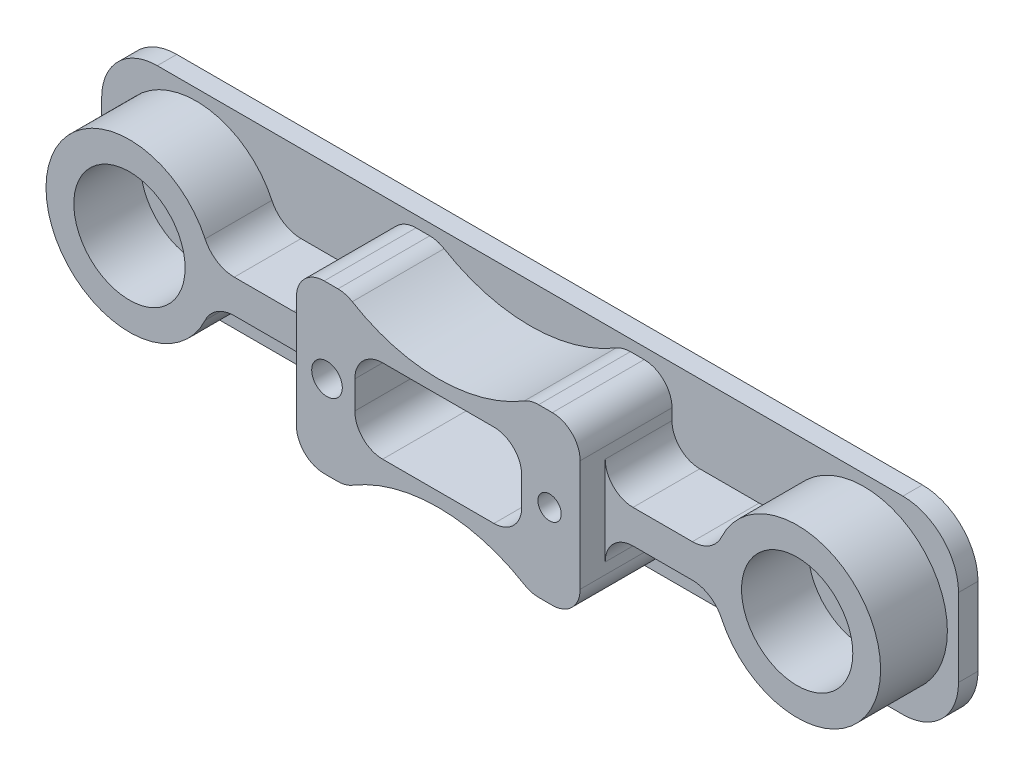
ISO-10303-21;
HEADER;
FILE_DESCRIPTION(('STEP AP214'),'2;1');
FILE_NAME('part.step','',(''),(''),'','','');
FILE_SCHEMA(('AUTOMOTIVE_DESIGN { 1 0 10303 214 1 1 1 1 }'));
ENDSEC;
DATA;
#1=APPLICATION_CONTEXT('core data for automotive mechanical design processes');
#2=APPLICATION_PROTOCOL_DEFINITION('international standard','automotive_design',2000,#1);
#3=PRODUCT_CONTEXT('',#1,'mechanical');
#4=PRODUCT('Part','Part','',(#3));
#5=PRODUCT_RELATED_PRODUCT_CATEGORY('part','',(#4));
#6=PRODUCT_DEFINITION_FORMATION('','',#4);
#7=PRODUCT_DEFINITION_CONTEXT('part definition',#1,'design');
#8=PRODUCT_DEFINITION('design','',#6,#7);
#9=PRODUCT_DEFINITION_SHAPE('','',#8);
#10=(LENGTH_UNIT() NAMED_UNIT(*) SI_UNIT(.MILLI.,.METRE.));
#11=(NAMED_UNIT(*) PLANE_ANGLE_UNIT() SI_UNIT($,.RADIAN.));
#12=(NAMED_UNIT(*) SI_UNIT($,.STERADIAN.) SOLID_ANGLE_UNIT());
#13=UNCERTAINTY_MEASURE_WITH_UNIT(LENGTH_MEASURE(1.E-05),#10,'distance_accuracy_value','');
#14=(GEOMETRIC_REPRESENTATION_CONTEXT(3) GLOBAL_UNCERTAINTY_ASSIGNED_CONTEXT((#13)) GLOBAL_UNIT_ASSIGNED_CONTEXT((#10,
#11,#12)) REPRESENTATION_CONTEXT('',''));
#15=CARTESIAN_POINT('',(0.,0.,0.));
#16=DIRECTION('',(0.,0.,1.));
#17=DIRECTION('',(1.,0.,0.));
#18=AXIS2_PLACEMENT_3D('',#15,#16,#17);
#19=CARTESIAN_POINT('',(-20.5,-15.,20.));
#20=DIRECTION('',(0.,1.,0.));
#21=DIRECTION('',(0.,0.,1.));
#22=AXIS2_PLACEMENT_3D('',#19,#20,#21);
#23=PLANE('',#22);
#24=DIRECTION('',(1.,0.,0.));
#25=VECTOR('',#24,1.);
#26=CARTESIAN_POINT('',(-20.5,-15.,3.5));
#27=LINE('',#26,#25);
#28=CARTESIAN_POINT('',(-20.5,-15.,3.5));
#29=VERTEX_POINT('',#28);
#30=CARTESIAN_POINT('',(-18.0277563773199,-15.,3.5));
#31=VERTEX_POINT('',#30);
#32=EDGE_CURVE('E500',#29,#31,#27,.T.);
#33=ORIENTED_EDGE('',*,*,#32,.T.);
#34=DIRECTION('',(0.,0.,1.));
#35=VECTOR('',#34,1.);
#36=CARTESIAN_POINT('',(-18.0277563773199,-15.,20.));
#37=LINE('',#36,#35);
#38=CARTESIAN_POINT('',(-18.0277563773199,-15.,20.));
#39=VERTEX_POINT('',#38);
#40=EDGE_CURVE('E780',#31,#39,#37,.T.);
#41=ORIENTED_EDGE('',*,*,#40,.T.);
#42=DIRECTION('',(1.,0.,0.));
#43=VECTOR('',#42,1.);
#44=CARTESIAN_POINT('',(-20.5,-15.,20.));
#45=LINE('',#44,#43);
#46=CARTESIAN_POINT('',(-20.5,-15.,20.));
#47=VERTEX_POINT('',#46);
#48=EDGE_CURVE('E471',#47,#39,#45,.T.);
#49=ORIENTED_EDGE('',*,*,#48,.F.);
#50=DIRECTION('',(0.,0.,-1.));
#51=VECTOR('',#50,1.);
#52=CARTESIAN_POINT('',(-20.5,-15.,20.));
#53=LINE('',#52,#51);
#54=EDGE_CURVE('E554',#47,#29,#53,.T.);
#55=ORIENTED_EDGE('',*,*,#54,.T.);
#56=EDGE_LOOP('',(#33,#41,#49,#55));
#57=FACE_BOUND('',#56,.T.);
#58=ADVANCED_FACE('F42',(#57),#23,.F.);
#59=CARTESIAN_POINT('',(-20.5,15.,20.));
#60=DIRECTION('',(0.,-1.,0.));
#61=DIRECTION('',(0.,0.,-1.));
#62=AXIS2_PLACEMENT_3D('',#59,#60,#61);
#63=PLANE('',#62);
#64=DIRECTION('',(-1.,0.,0.));
#65=VECTOR('',#64,1.);
#66=CARTESIAN_POINT('',(-20.5,15.,3.5));
#67=LINE('',#66,#65);
#68=CARTESIAN_POINT('',(20.5,15.,3.5));
#69=VERTEX_POINT('',#68);
#70=CARTESIAN_POINT('',(18.0277563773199,15.,3.5));
#71=VERTEX_POINT('',#70);
#72=EDGE_CURVE('E516',#69,#71,#67,.T.);
#73=ORIENTED_EDGE('',*,*,#72,.T.);
#74=DIRECTION('',(0.,0.,-1.));
#75=VECTOR('',#74,1.);
#76=CARTESIAN_POINT('',(18.0277563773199,15.,20.));
#77=LINE('',#76,#75);
#78=CARTESIAN_POINT('',(18.0277563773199,15.,20.));
#79=VERTEX_POINT('',#78);
#80=EDGE_CURVE('E766',#71,#79,#77,.F.);
#81=ORIENTED_EDGE('',*,*,#80,.T.);
#82=DIRECTION('',(-1.,0.,0.));
#83=VECTOR('',#82,1.);
#84=CARTESIAN_POINT('',(-20.5,15.,20.));
#85=LINE('',#84,#83);
#86=CARTESIAN_POINT('',(20.5,15.,20.));
#87=VERTEX_POINT('',#86);
#88=EDGE_CURVE('E485',#87,#79,#85,.T.);
#89=ORIENTED_EDGE('',*,*,#88,.F.);
#90=DIRECTION('',(0.,0.,-1.));
#91=VECTOR('',#90,1.);
#92=CARTESIAN_POINT('',(20.5,15.,20.));
#93=LINE('',#92,#91);
#94=EDGE_CURVE('E538',#87,#69,#93,.T.);
#95=ORIENTED_EDGE('',*,*,#94,.T.);
#96=EDGE_LOOP('',(#73,#81,#89,#95));
#97=FACE_BOUND('',#96,.T.);
#98=ADVANCED_FACE('F910',(#97),#63,.F.);
#99=CARTESIAN_POINT('',(-18.0277563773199,15.,20.));
#100=VERTEX_POINT('',#99);
#101=CARTESIAN_POINT('',(-20.5,15.,20.));
#102=VERTEX_POINT('',#101);
#103=EDGE_CURVE('E484',#100,#102,#85,.T.);
#104=ORIENTED_EDGE('',*,*,#103,.F.);
#105=DIRECTION('',(0.,0.,-1.));
#106=VECTOR('',#105,1.);
#107=CARTESIAN_POINT('',(-18.0277563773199,15.,3.5));
#108=LINE('',#107,#106);
#109=CARTESIAN_POINT('',(-18.0277563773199,15.,3.5));
#110=VERTEX_POINT('',#109);
#111=EDGE_CURVE('E763',#100,#110,#108,.T.);
#112=ORIENTED_EDGE('',*,*,#111,.T.);
#113=CARTESIAN_POINT('',(-20.5,15.,3.5));
#114=VERTEX_POINT('',#113);
#115=EDGE_CURVE('E515',#110,#114,#67,.T.);
#116=ORIENTED_EDGE('',*,*,#115,.T.);
#117=DIRECTION('',(0.,0.,-1.));
#118=VECTOR('',#117,1.);
#119=CARTESIAN_POINT('',(-20.5,15.,20.));
#120=LINE('',#119,#118);
#121=EDGE_CURVE('E534',#102,#114,#120,.T.);
#122=ORIENTED_EDGE('',*,*,#121,.F.);
#123=EDGE_LOOP('',(#104,#112,#116,#122));
#124=FACE_BOUND('',#123,.T.);
#125=ADVANCED_FACE('F882',(#124),#63,.F.);
#126=CARTESIAN_POINT('',(67.,7.,3.5));
#127=DIRECTION('',(0.,0.,-1.));
#128=DIRECTION('',(-1.,0.,0.));
#129=AXIS2_PLACEMENT_3D('',#126,#127,#128);
#130=PLANE('',#129);
#131=CARTESIAN_POINT('',(67.,7.,3.5));
#132=DIRECTION('',(0.,0.,1.));
#133=DIRECTION('',(-1.,0.,0.));
#134=AXIS2_PLACEMENT_3D('',#131,#132,#133);
#135=CIRCLE('',#134,10.);
#136=CARTESIAN_POINT('',(77.,6.99999999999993,3.5));
#137=VERTEX_POINT('',#136);
#138=CARTESIAN_POINT('',(66.9999999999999,17.,3.5));
#139=VERTEX_POINT('',#138);
#140=EDGE_CURVE('E657',#137,#139,#135,.T.);
#141=ORIENTED_EDGE('',*,*,#140,.T.);
#142=DIRECTION('',(-1.,0.,0.));
#143=VECTOR('',#142,1.);
#144=CARTESIAN_POINT('',(-66.9999999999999,17.,3.5));
#145=LINE('',#144,#143);
#146=CARTESIAN_POINT('',(-66.9999999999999,17.,3.5));
#147=VERTEX_POINT('',#146);
#148=EDGE_CURVE('E661',#139,#147,#145,.T.);
#149=ORIENTED_EDGE('',*,*,#148,.T.);
#150=CARTESIAN_POINT('',(-67.,7.,3.5));
#151=DIRECTION('',(0.,0.,1.));
#152=DIRECTION('',(1.,0.,0.));
#153=AXIS2_PLACEMENT_3D('',#150,#151,#152);
#154=CIRCLE('',#153,10.);
#155=CARTESIAN_POINT('',(-77.,6.99999999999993,3.5));
#156=VERTEX_POINT('',#155);
#157=EDGE_CURVE('E665',#147,#156,#154,.T.);
#158=ORIENTED_EDGE('',*,*,#157,.T.);
#159=DIRECTION('',(0.,-1.,0.));
#160=VECTOR('',#159,1.);
#161=CARTESIAN_POINT('',(-77.,6.99999999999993,3.5));
#162=LINE('',#161,#160);
#163=CARTESIAN_POINT('',(-77.,-6.99999999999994,3.5));
#164=VERTEX_POINT('',#163);
#165=EDGE_CURVE('E668',#156,#164,#162,.T.);
#166=ORIENTED_EDGE('',*,*,#165,.T.);
#167=CARTESIAN_POINT('',(-67.,-7.00000000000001,3.5));
#168=DIRECTION('',(0.,0.,1.));
#169=DIRECTION('',(1.,0.,0.));
#170=AXIS2_PLACEMENT_3D('',#167,#168,#169);
#171=CIRCLE('',#170,10.);
#172=CARTESIAN_POINT('',(-66.9999999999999,-17.,3.5));
#173=VERTEX_POINT('',#172);
#174=EDGE_CURVE('E671',#164,#173,#171,.T.);
#175=ORIENTED_EDGE('',*,*,#174,.T.);
#176=DIRECTION('',(1.,0.,0.));
#177=VECTOR('',#176,1.);
#178=CARTESIAN_POINT('',(-66.9999999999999,-17.,3.5));
#179=LINE('',#178,#177);
#180=CARTESIAN_POINT('',(66.9999999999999,-17.,3.5));
#181=VERTEX_POINT('',#180);
#182=EDGE_CURVE('E674',#173,#181,#179,.T.);
#183=ORIENTED_EDGE('',*,*,#182,.T.);
#184=CARTESIAN_POINT('',(67.,-7.00000000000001,3.5));
#185=DIRECTION('',(0.,0.,1.));
#186=DIRECTION('',(-1.,0.,0.));
#187=AXIS2_PLACEMENT_3D('',#184,#185,#186);
#188=CIRCLE('',#187,10.);
#189=CARTESIAN_POINT('',(77.,-6.99999999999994,3.5));
#190=VERTEX_POINT('',#189);
#191=EDGE_CURVE('E677',#181,#190,#188,.T.);
#192=ORIENTED_EDGE('',*,*,#191,.T.);
#193=DIRECTION('',(0.,1.,0.));
#194=VECTOR('',#193,1.);
#195=CARTESIAN_POINT('',(77.,6.99999999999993,3.5));
#196=LINE('',#195,#194);
#197=EDGE_CURVE('E680',#190,#137,#196,.T.);
#198=ORIENTED_EDGE('',*,*,#197,.T.);
#199=EDGE_LOOP('',(#141,#149,#158,#166,#175,#183,#192,#198));
#200=FACE_BOUND('',#199,.T.);
#201=DIRECTION('',(0.,-1.,0.));
#202=VECTOR('',#201,1.);
#203=CARTESIAN_POINT('',(-25.5,9.99999999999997,3.5));
#204=LINE('',#203,#202);
#205=CARTESIAN_POINT('',(-25.5,-7.99999999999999,3.5));
#206=VERTEX_POINT('',#205);
#207=CARTESIAN_POINT('',(-25.5,-9.99999999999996,3.5));
#208=VERTEX_POINT('',#207);
#209=EDGE_CURVE('E523',#206,#208,#204,.T.);
#210=ORIENTED_EDGE('',*,*,#209,.F.);
#211=CARTESIAN_POINT('',(-30.5,-8.,3.5));
#212=DIRECTION('',(0.,0.,-1.));
#213=DIRECTION('',(-1.,0.,0.));
#214=AXIS2_PLACEMENT_3D('',#211,#212,#213);
#215=CIRCLE('',#214,5.);
#216=CARTESIAN_POINT('',(-30.5,-3.,3.5));
#217=VERTEX_POINT('',#216);
#218=EDGE_CURVE('E813',#206,#217,#215,.F.);
#219=ORIENTED_EDGE('',*,*,#218,.T.);
#220=DIRECTION('',(1.,0.,0.));
#221=VECTOR('',#220,1.);
#222=CARTESIAN_POINT('',(41.1658124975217,-3.,3.5));
#223=LINE('',#222,#221);
#224=CARTESIAN_POINT('',(-41.1658124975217,-3.,3.5));
#225=VERTEX_POINT('',#224);
#226=EDGE_CURVE('E614',#225,#217,#223,.T.);
#227=ORIENTED_EDGE('',*,*,#226,.F.);
#228=CARTESIAN_POINT('',(-41.1658124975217,-8.78027578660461,3.5));
#229=DIRECTION('',(0.,0.,-1.));
#230=DIRECTION('',(-1.,0.,0.));
#231=AXIS2_PLACEMENT_3D('',#228,#229,#230);
#232=CIRCLE('',#231,5.78027578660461);
#233=CARTESIAN_POINT('',(-46.4047611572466,-6.33793979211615,3.5));
#234=VERTEX_POINT('',#233);
#235=EDGE_CURVE('E609',#234,#225,#232,.T.);
#236=ORIENTED_EDGE('',*,*,#235,.F.);
#237=CARTESIAN_POINT('',(-60.,0.,3.5));
#238=DIRECTION('',(0.,0.,1.));
#239=DIRECTION('',(-1.,0.,0.));
#240=AXIS2_PLACEMENT_3D('',#237,#238,#239);
#241=CIRCLE('',#240,15.);
#242=CARTESIAN_POINT('',(-46.4047611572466,6.33793979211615,3.5));
#243=VERTEX_POINT('',#242);
#244=EDGE_CURVE('E605',#243,#234,#241,.T.);
#245=ORIENTED_EDGE('',*,*,#244,.F.);
#246=CARTESIAN_POINT('',(-41.1658124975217,8.7802757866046,3.5));
#247=DIRECTION('',(0.,0.,-1.));
#248=DIRECTION('',(1.,0.,0.));
#249=AXIS2_PLACEMENT_3D('',#246,#247,#248);
#250=CIRCLE('',#249,5.78027578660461);
#251=CARTESIAN_POINT('',(-41.1658124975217,2.99999999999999,3.5));
#252=VERTEX_POINT('',#251);
#253=EDGE_CURVE('E571',#252,#243,#250,.T.);
#254=ORIENTED_EDGE('',*,*,#253,.F.);
#255=DIRECTION('',(-1.,0.,0.));
#256=VECTOR('',#255,1.);
#257=CARTESIAN_POINT('',(41.1658124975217,2.99999999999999,3.5));
#258=LINE('',#257,#256);
#259=CARTESIAN_POINT('',(-30.5,2.99999999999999,3.5));
#260=VERTEX_POINT('',#259);
#261=EDGE_CURVE('E630',#260,#252,#258,.T.);
#262=ORIENTED_EDGE('',*,*,#261,.F.);
#263=CARTESIAN_POINT('',(-30.5,7.99999999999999,3.5));
#264=DIRECTION('',(0.,0.,-1.));
#265=DIRECTION('',(-1.,0.,0.));
#266=AXIS2_PLACEMENT_3D('',#263,#264,#265);
#267=CIRCLE('',#266,5.);
#268=CARTESIAN_POINT('',(-25.5,8.,3.5));
#269=VERTEX_POINT('',#268);
#270=EDGE_CURVE('E810',#260,#269,#267,.F.);
#271=ORIENTED_EDGE('',*,*,#270,.T.);
#272=CARTESIAN_POINT('',(-25.5,9.99999999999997,3.5));
#273=VERTEX_POINT('',#272);
#274=EDGE_CURVE('E470',#273,#269,#204,.T.);
#275=ORIENTED_EDGE('',*,*,#274,.F.);
#276=CARTESIAN_POINT('',(-20.5,10.,3.5));
#277=DIRECTION('',(0.,0.,1.));
#278=DIRECTION('',(1.,0.,0.));
#279=AXIS2_PLACEMENT_3D('',#276,#277,#278);
#280=CIRCLE('',#279,5.);
#281=EDGE_CURVE('E520',#114,#273,#280,.T.);
#282=ORIENTED_EDGE('',*,*,#281,.F.);
#283=ORIENTED_EDGE('',*,*,#115,.F.);
#284=CARTESIAN_POINT('',(-18.0277563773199,10.,3.5));
#285=DIRECTION('',(0.,0.,-1.));
#286=DIRECTION('',(-1.,0.,0.));
#287=AXIS2_PLACEMENT_3D('',#284,#285,#286);
#288=CIRCLE('',#287,5.);
#289=CARTESIAN_POINT('',(-15.4523626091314,14.2857142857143,3.5));
#290=VERTEX_POINT('',#289);
#291=EDGE_CURVE('E784',#110,#290,#288,.T.);
#292=ORIENTED_EDGE('',*,*,#291,.T.);
#293=CARTESIAN_POINT('',(0.,40.,3.5));
#294=DIRECTION('',(0.,0.,-1.));
#295=DIRECTION('',(-1.,0.,0.));
#296=AXIS2_PLACEMENT_3D('',#293,#294,#295);
#297=CIRCLE('',#296,30.);
#298=CARTESIAN_POINT('',(15.4523626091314,14.2857142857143,3.5));
#299=VERTEX_POINT('',#298);
#300=EDGE_CURVE('E961',#299,#290,#297,.T.);
#301=ORIENTED_EDGE('',*,*,#300,.F.);
#302=CARTESIAN_POINT('',(18.0277563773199,10.,3.5));
#303=DIRECTION('',(0.,0.,-1.));
#304=DIRECTION('',(-1.,0.,0.));
#305=AXIS2_PLACEMENT_3D('',#302,#303,#304);
#306=CIRCLE('',#305,5.);
#307=EDGE_CURVE('E787',#299,#71,#306,.T.);
#308=ORIENTED_EDGE('',*,*,#307,.T.);
#309=ORIENTED_EDGE('',*,*,#72,.F.);
#310=CARTESIAN_POINT('',(20.5,10.,3.5));
#311=DIRECTION('',(0.,0.,1.));
#312=DIRECTION('',(1.,0.,0.));
#313=AXIS2_PLACEMENT_3D('',#310,#311,#312);
#314=CIRCLE('',#313,5.);
#315=CARTESIAN_POINT('',(25.5,9.99999999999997,3.5));
#316=VERTEX_POINT('',#315);
#317=EDGE_CURVE('E512',#316,#69,#314,.T.);
#318=ORIENTED_EDGE('',*,*,#317,.F.);
#319=DIRECTION('',(0.,1.,0.));
#320=VECTOR('',#319,1.);
#321=CARTESIAN_POINT('',(25.5,9.99999999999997,3.5));
#322=LINE('',#321,#320);
#323=CARTESIAN_POINT('',(25.5,8.,3.5));
#324=VERTEX_POINT('',#323);
#325=EDGE_CURVE('E507',#324,#316,#322,.T.);
#326=ORIENTED_EDGE('',*,*,#325,.F.);
#327=CARTESIAN_POINT('',(30.5,7.99999999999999,3.5));
#328=DIRECTION('',(0.,0.,-1.));
#329=DIRECTION('',(-1.,0.,0.));
#330=AXIS2_PLACEMENT_3D('',#327,#328,#329);
#331=CIRCLE('',#330,5.);
#332=CARTESIAN_POINT('',(30.5,2.99999999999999,3.5));
#333=VERTEX_POINT('',#332);
#334=EDGE_CURVE('E807',#324,#333,#331,.F.);
#335=ORIENTED_EDGE('',*,*,#334,.T.);
#336=CARTESIAN_POINT('',(41.1658124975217,2.99999999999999,3.5));
#337=VERTEX_POINT('',#336);
#338=EDGE_CURVE('E577',#337,#333,#258,.T.);
#339=ORIENTED_EDGE('',*,*,#338,.F.);
#340=CARTESIAN_POINT('',(41.1658124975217,8.7802757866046,3.5));
#341=DIRECTION('',(0.,0.,-1.));
#342=DIRECTION('',(-1.,0.,0.));
#343=AXIS2_PLACEMENT_3D('',#340,#341,#342);
#344=CIRCLE('',#343,5.78027578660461);
#345=CARTESIAN_POINT('',(46.4047611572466,6.33793979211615,3.5));
#346=VERTEX_POINT('',#345);
#347=EDGE_CURVE('E626',#346,#337,#344,.T.);
#348=ORIENTED_EDGE('',*,*,#347,.F.);
#349=CARTESIAN_POINT('',(60.,0.,3.5));
#350=DIRECTION('',(0.,0.,1.));
#351=DIRECTION('',(1.,0.,0.));
#352=AXIS2_PLACEMENT_3D('',#349,#350,#351);
#353=CIRCLE('',#352,15.);
#354=CARTESIAN_POINT('',(46.4047611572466,-6.33793979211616,3.5));
#355=VERTEX_POINT('',#354);
#356=EDGE_CURVE('E622',#355,#346,#353,.T.);
#357=ORIENTED_EDGE('',*,*,#356,.F.);
#358=CARTESIAN_POINT('',(41.1658124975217,-8.78027578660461,3.5));
#359=DIRECTION('',(0.,0.,-1.));
#360=DIRECTION('',(1.,0.,0.));
#361=AXIS2_PLACEMENT_3D('',#358,#359,#360);
#362=CIRCLE('',#361,5.78027578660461);
#363=CARTESIAN_POINT('',(41.1658124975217,-3.,3.5));
#364=VERTEX_POINT('',#363);
#365=EDGE_CURVE('E618',#364,#355,#362,.T.);
#366=ORIENTED_EDGE('',*,*,#365,.F.);
#367=CARTESIAN_POINT('',(30.5,-3.,3.5));
#368=VERTEX_POINT('',#367);
#369=EDGE_CURVE('E613',#368,#364,#223,.T.);
#370=ORIENTED_EDGE('',*,*,#369,.F.);
#371=CARTESIAN_POINT('',(30.5,-8.,3.5));
#372=DIRECTION('',(0.,0.,-1.));
#373=DIRECTION('',(-1.,0.,0.));
#374=AXIS2_PLACEMENT_3D('',#371,#372,#373);
#375=CIRCLE('',#374,5.);
#376=CARTESIAN_POINT('',(25.5,-7.99999999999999,3.5));
#377=VERTEX_POINT('',#376);
#378=EDGE_CURVE('E804',#368,#377,#375,.F.);
#379=ORIENTED_EDGE('',*,*,#378,.T.);
#380=CARTESIAN_POINT('',(25.5,-9.99999999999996,3.5));
#381=VERTEX_POINT('',#380);
#382=EDGE_CURVE('E508',#381,#377,#322,.T.);
#383=ORIENTED_EDGE('',*,*,#382,.F.);
#384=CARTESIAN_POINT('',(20.5,-10.,3.5));
#385=DIRECTION('',(0.,0.,1.));
#386=DIRECTION('',(1.,0.,0.));
#387=AXIS2_PLACEMENT_3D('',#384,#385,#386);
#388=CIRCLE('',#387,5.);
#389=CARTESIAN_POINT('',(20.5,-15.,3.5));
#390=VERTEX_POINT('',#389);
#391=EDGE_CURVE('E504',#390,#381,#388,.T.);
#392=ORIENTED_EDGE('',*,*,#391,.F.);
#393=CARTESIAN_POINT('',(18.0277563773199,-15.,3.5));
#394=VERTEX_POINT('',#393);
#395=EDGE_CURVE('E499',#394,#390,#27,.T.);
#396=ORIENTED_EDGE('',*,*,#395,.F.);
#397=CARTESIAN_POINT('',(18.0277563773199,-10.,3.5));
#398=DIRECTION('',(0.,0.,-1.));
#399=DIRECTION('',(-1.,0.,0.));
#400=AXIS2_PLACEMENT_3D('',#397,#398,#399);
#401=CIRCLE('',#400,5.);
#402=CARTESIAN_POINT('',(15.4523626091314,-14.2857142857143,3.5));
#403=VERTEX_POINT('',#402);
#404=EDGE_CURVE('E790',#394,#403,#401,.T.);
#405=ORIENTED_EDGE('',*,*,#404,.T.);
#406=CARTESIAN_POINT('',(0.,-40.,3.5));
#407=DIRECTION('',(0.,0.,-1.));
#408=DIRECTION('',(-1.,0.,0.));
#409=AXIS2_PLACEMENT_3D('',#406,#407,#408);
#410=CIRCLE('',#409,30.);
#411=CARTESIAN_POINT('',(-15.4523626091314,-14.2857142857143,3.5));
#412=VERTEX_POINT('',#411);
#413=EDGE_CURVE('E951',#403,#412,#410,.F.);
#414=ORIENTED_EDGE('',*,*,#413,.T.);
#415=CARTESIAN_POINT('',(-18.0277563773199,-10.,3.5));
#416=DIRECTION('',(0.,0.,-1.));
#417=DIRECTION('',(-1.,0.,0.));
#418=AXIS2_PLACEMENT_3D('',#415,#416,#417);
#419=CIRCLE('',#418,5.);
#420=EDGE_CURVE('E793',#412,#31,#419,.T.);
#421=ORIENTED_EDGE('',*,*,#420,.T.);
#422=ORIENTED_EDGE('',*,*,#32,.F.);
#423=CARTESIAN_POINT('',(-20.5,-10.,3.5));
#424=DIRECTION('',(0.,0.,1.));
#425=DIRECTION('',(1.,0.,0.));
#426=AXIS2_PLACEMENT_3D('',#423,#424,#425);
#427=CIRCLE('',#426,5.);
#428=EDGE_CURVE('E464',#208,#29,#427,.T.);
#429=ORIENTED_EDGE('',*,*,#428,.F.);
#430=EDGE_LOOP('',(#210,#219,#227,#236,#245,#254,#262,#271,#275,#282,#283,#292,#301,#308,#309,
#318,#326,#335,#339,#348,#357,#366,#370,#379,#383,#392,#396,#405,#414,#421,#422,#429));
#431=FACE_BOUND('',#430,.T.);
#432=ADVANCED_FACE('F855',(#200,#431),#130,.F.);
#433=CARTESIAN_POINT('',(41.1658124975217,-3.,15.5));
#434=DIRECTION('',(0.,1.,0.));
#435=DIRECTION('',(0.,0.,1.));
#436=AXIS2_PLACEMENT_3D('',#433,#434,#435);
#437=PLANE('',#436);
#438=DIRECTION('',(1.,0.,0.));
#439=VECTOR('',#438,1.);
#440=CARTESIAN_POINT('',(41.1658124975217,-3.,15.5));
#441=LINE('',#440,#439);
#442=CARTESIAN_POINT('',(30.5,-3.,15.5));
#443=VERTEX_POINT('',#442);
#444=CARTESIAN_POINT('',(41.1658124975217,-3.,15.5));
#445=VERTEX_POINT('',#444);
#446=EDGE_CURVE('E583',#443,#445,#441,.T.);
#447=ORIENTED_EDGE('',*,*,#446,.F.);
#448=DIRECTION('',(0.,0.,1.));
#449=VECTOR('',#448,1.);
#450=CARTESIAN_POINT('',(30.5,-3.,3.5));
#451=LINE('',#450,#449);
#452=EDGE_CURVE('E829',#443,#368,#451,.F.);
#453=ORIENTED_EDGE('',*,*,#452,.T.);
#454=ORIENTED_EDGE('',*,*,#369,.T.);
#455=DIRECTION('',(0.,0.,-1.));
#456=VECTOR('',#455,1.);
#457=CARTESIAN_POINT('',(41.1658124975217,-3.,15.5));
#458=LINE('',#457,#456);
#459=EDGE_CURVE('E644',#445,#364,#458,.T.);
#460=ORIENTED_EDGE('',*,*,#459,.F.);
#461=EDGE_LOOP('',(#447,#453,#454,#460));
#462=FACE_BOUND('',#461,.T.);
#463=ADVANCED_FACE('F881',(#462),#437,.F.);
#464=ORIENTED_EDGE('',*,*,#226,.T.);
#465=DIRECTION('',(0.,0.,-1.));
#466=VECTOR('',#465,1.);
#467=CARTESIAN_POINT('',(-30.5,-3.,15.5));
#468=LINE('',#467,#466);
#469=CARTESIAN_POINT('',(-30.5,-3.,15.5));
#470=VERTEX_POINT('',#469);
#471=EDGE_CURVE('E816',#217,#470,#468,.F.);
#472=ORIENTED_EDGE('',*,*,#471,.T.);
#473=CARTESIAN_POINT('',(-41.1658124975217,-3.,15.5));
#474=VERTEX_POINT('',#473);
#475=EDGE_CURVE('E584',#474,#470,#441,.T.);
#476=ORIENTED_EDGE('',*,*,#475,.F.);
#477=DIRECTION('',(0.,0.,-1.));
#478=VECTOR('',#477,1.);
#479=CARTESIAN_POINT('',(-41.1658124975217,-3.,15.5));
#480=LINE('',#479,#478);
#481=EDGE_CURVE('E647',#474,#225,#480,.T.);
#482=ORIENTED_EDGE('',*,*,#481,.T.);
#483=EDGE_LOOP('',(#464,#472,#476,#482));
#484=FACE_BOUND('',#483,.T.);
#485=ADVANCED_FACE('F900',(#484),#437,.F.);
#486=CARTESIAN_POINT('',(41.1658124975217,2.99999999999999,15.5));
#487=DIRECTION('',(0.,-1.,0.));
#488=DIRECTION('',(0.,0.,-1.));
#489=AXIS2_PLACEMENT_3D('',#486,#487,#488);
#490=PLANE('',#489);
#491=ORIENTED_EDGE('',*,*,#338,.T.);
#492=DIRECTION('',(0.,0.,-1.));
#493=VECTOR('',#492,1.);
#494=CARTESIAN_POINT('',(30.5,2.99999999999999,15.5));
#495=LINE('',#494,#493);
#496=CARTESIAN_POINT('',(30.5,2.99999999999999,15.5));
#497=VERTEX_POINT('',#496);
#498=EDGE_CURVE('E64',#333,#497,#495,.F.);
#499=ORIENTED_EDGE('',*,*,#498,.T.);
#500=DIRECTION('',(-1.,0.,0.));
#501=VECTOR('',#500,1.);
#502=CARTESIAN_POINT('',(41.1658124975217,2.99999999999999,15.5));
#503=LINE('',#502,#501);
#504=CARTESIAN_POINT('',(41.1658124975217,2.99999999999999,15.5));
#505=VERTEX_POINT('',#504);
#506=EDGE_CURVE('E598',#505,#497,#503,.T.);
#507=ORIENTED_EDGE('',*,*,#506,.F.);
#508=DIRECTION('',(0.,0.,-1.));
#509=VECTOR('',#508,1.);
#510=CARTESIAN_POINT('',(41.1658124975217,2.99999999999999,15.5));
#511=LINE('',#510,#509);
#512=EDGE_CURVE('E635',#505,#337,#511,.T.);
#513=ORIENTED_EDGE('',*,*,#512,.T.);
#514=EDGE_LOOP('',(#491,#499,#507,#513));
#515=FACE_BOUND('',#514,.T.);
#516=ADVANCED_FACE('F905',(#515),#490,.F.);
#517=CARTESIAN_POINT('',(-30.5,2.99999999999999,15.5));
#518=VERTEX_POINT('',#517);
#519=CARTESIAN_POINT('',(-41.1658124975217,2.99999999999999,15.5));
#520=VERTEX_POINT('',#519);
#521=EDGE_CURVE('E597',#518,#520,#503,.T.);
#522=ORIENTED_EDGE('',*,*,#521,.F.);
#523=DIRECTION('',(0.,0.,1.));
#524=VECTOR('',#523,1.);
#525=CARTESIAN_POINT('',(-30.5,2.99999999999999,3.5));
#526=LINE('',#525,#524);
#527=EDGE_CURVE('E818',#518,#260,#526,.F.);
#528=ORIENTED_EDGE('',*,*,#527,.T.);
#529=ORIENTED_EDGE('',*,*,#261,.T.);
#530=DIRECTION('',(0.,0.,-1.));
#531=VECTOR('',#530,1.);
#532=CARTESIAN_POINT('',(-41.1658124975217,2.99999999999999,15.5));
#533=LINE('',#532,#531);
#534=EDGE_CURVE('E601',#520,#252,#533,.T.);
#535=ORIENTED_EDGE('',*,*,#534,.F.);
#536=EDGE_LOOP('',(#522,#528,#529,#535));
#537=FACE_BOUND('',#536,.T.);
#538=ADVANCED_FACE('F1450',(#537),#490,.F.);
#539=CARTESIAN_POINT('',(-41.1658124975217,8.7802757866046,15.5));
#540=DIRECTION('',(0.,0.,1.));
#541=DIRECTION('',(1.,0.,0.));
#542=AXIS2_PLACEMENT_3D('',#539,#540,#541);
#543=PLANE('',#542);
#544=CARTESIAN_POINT('',(60.,0.,15.5));
#545=DIRECTION('',(0.,0.,1.));
#546=DIRECTION('',(1.,0.,0.));
#547=AXIS2_PLACEMENT_3D('',#544,#545,#546);
#548=CIRCLE('',#547,9.99999999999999);
#549=CARTESIAN_POINT('',(70.,0.,15.5));
#550=VERTEX_POINT('',#549);
#551=EDGE_CURVE('E557',#550,#550,#548,.T.);
#552=ORIENTED_EDGE('',*,*,#551,.F.);
#553=EDGE_LOOP('',(#552));
#554=FACE_BOUND('',#553,.T.);
#555=ORIENTED_EDGE('',*,*,#506,.T.);
#556=CARTESIAN_POINT('',(30.5,7.99999999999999,15.5));
#557=DIRECTION('',(0.,0.,1.));
#558=DIRECTION('',(1.,0.,0.));
#559=AXIS2_PLACEMENT_3D('',#556,#557,#558);
#560=CIRCLE('',#559,5.);
#561=CARTESIAN_POINT('',(25.5,8.,15.5));
#562=VERTEX_POINT('',#561);
#563=EDGE_CURVE('E51',#497,#562,#560,.F.);
#564=ORIENTED_EDGE('',*,*,#563,.T.);
#565=DIRECTION('',(0.,-1.,0.));
#566=VECTOR('',#565,1.);
#567=CARTESIAN_POINT('',(25.5,8.78027578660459,15.5));
#568=LINE('',#567,#566);
#569=CARTESIAN_POINT('',(25.5,-8.,15.5));
#570=VERTEX_POINT('',#569);
#571=EDGE_CURVE('E741',#562,#570,#568,.T.);
#572=ORIENTED_EDGE('',*,*,#571,.T.);
#573=CARTESIAN_POINT('',(30.5,-8.,15.5));
#574=DIRECTION('',(0.,0.,1.));
#575=DIRECTION('',(1.,0.,0.));
#576=AXIS2_PLACEMENT_3D('',#573,#574,#575);
#577=CIRCLE('',#576,5.);
#578=EDGE_CURVE('E12',#570,#443,#577,.F.);
#579=ORIENTED_EDGE('',*,*,#578,.T.);
#580=ORIENTED_EDGE('',*,*,#446,.T.);
#581=CARTESIAN_POINT('',(41.1658124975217,-8.78027578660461,15.5));
#582=DIRECTION('',(0.,0.,-1.));
#583=DIRECTION('',(1.,0.,0.));
#584=AXIS2_PLACEMENT_3D('',#581,#582,#583);
#585=CIRCLE('',#584,5.78027578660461);
#586=CARTESIAN_POINT('',(46.4047611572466,-6.33793979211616,15.5));
#587=VERTEX_POINT('',#586);
#588=EDGE_CURVE('E588',#445,#587,#585,.T.);
#589=ORIENTED_EDGE('',*,*,#588,.T.);
#590=CARTESIAN_POINT('',(60.,0.,15.5));
#591=DIRECTION('',(0.,0.,1.));
#592=DIRECTION('',(1.,0.,0.));
#593=AXIS2_PLACEMENT_3D('',#590,#591,#592);
#594=CIRCLE('',#593,15.);
#595=CARTESIAN_POINT('',(46.4047611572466,6.33793979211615,15.5));
#596=VERTEX_POINT('',#595);
#597=EDGE_CURVE('E591',#587,#596,#594,.T.);
#598=ORIENTED_EDGE('',*,*,#597,.T.);
#599=CARTESIAN_POINT('',(41.1658124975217,8.7802757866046,15.5));
#600=DIRECTION('',(0.,0.,-1.));
#601=DIRECTION('',(-1.,0.,0.));
#602=AXIS2_PLACEMENT_3D('',#599,#600,#601);
#603=CIRCLE('',#602,5.78027578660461);
#604=EDGE_CURVE('E594',#596,#505,#603,.T.);
#605=ORIENTED_EDGE('',*,*,#604,.T.);
#606=EDGE_LOOP('',(#555,#564,#572,#579,#580,#589,#598,#605));
#607=FACE_BOUND('',#606,.T.);
#608=ADVANCED_FACE('F843',(#554,#607),#543,.T.);
#609=CARTESIAN_POINT('',(-60.,0.,15.5));
#610=DIRECTION('',(0.,0.,1.));
#611=DIRECTION('',(1.,0.,0.));
#612=AXIS2_PLACEMENT_3D('',#609,#610,#611);
#613=CIRCLE('',#612,10.);
#614=CARTESIAN_POINT('',(-50.,0.,15.5));
#615=VERTEX_POINT('',#614);
#616=EDGE_CURVE('E564',#615,#615,#613,.T.);
#617=ORIENTED_EDGE('',*,*,#616,.F.);
#618=EDGE_LOOP('',(#617));
#619=FACE_BOUND('',#618,.T.);
#620=ORIENTED_EDGE('',*,*,#475,.T.);
#621=CARTESIAN_POINT('',(-30.5,-8.,15.5));
#622=DIRECTION('',(0.,0.,1.));
#623=DIRECTION('',(1.,0.,0.));
#624=AXIS2_PLACEMENT_3D('',#621,#622,#623);
#625=CIRCLE('',#624,5.);
#626=CARTESIAN_POINT('',(-25.5,-8.,15.5));
#627=VERTEX_POINT('',#626);
#628=EDGE_CURVE('E831',#470,#627,#625,.F.);
#629=ORIENTED_EDGE('',*,*,#628,.T.);
#630=DIRECTION('',(0.,1.,0.));
#631=VECTOR('',#630,1.);
#632=CARTESIAN_POINT('',(-25.5,8.7802757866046,15.5));
#633=LINE('',#632,#631);
#634=CARTESIAN_POINT('',(-25.5,7.99999999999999,15.5));
#635=VERTEX_POINT('',#634);
#636=EDGE_CURVE('E738',#627,#635,#633,.T.);
#637=ORIENTED_EDGE('',*,*,#636,.T.);
#638=CARTESIAN_POINT('',(-30.5,7.99999999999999,15.5));
#639=DIRECTION('',(0.,0.,1.));
#640=DIRECTION('',(1.,0.,0.));
#641=AXIS2_PLACEMENT_3D('',#638,#639,#640);
#642=CIRCLE('',#641,5.);
#643=EDGE_CURVE('E835',#635,#518,#642,.F.);
#644=ORIENTED_EDGE('',*,*,#643,.T.);
#645=ORIENTED_EDGE('',*,*,#521,.T.);
#646=CARTESIAN_POINT('',(-41.1658124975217,8.7802757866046,15.5));
#647=DIRECTION('',(0.,0.,-1.));
#648=DIRECTION('',(1.,0.,0.));
#649=AXIS2_PLACEMENT_3D('',#646,#647,#648);
#650=CIRCLE('',#649,5.78027578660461);
#651=CARTESIAN_POINT('',(-46.4047611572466,6.33793979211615,15.5));
#652=VERTEX_POINT('',#651);
#653=EDGE_CURVE('E572',#520,#652,#650,.T.);
#654=ORIENTED_EDGE('',*,*,#653,.T.);
#655=CARTESIAN_POINT('',(-60.,0.,15.5));
#656=DIRECTION('',(0.,0.,1.));
#657=DIRECTION('',(-1.,0.,0.));
#658=AXIS2_PLACEMENT_3D('',#655,#656,#657);
#659=CIRCLE('',#658,15.);
#660=CARTESIAN_POINT('',(-46.4047611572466,-6.33793979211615,15.5));
#661=VERTEX_POINT('',#660);
#662=EDGE_CURVE('E576',#652,#661,#659,.T.);
#663=ORIENTED_EDGE('',*,*,#662,.T.);
#664=CARTESIAN_POINT('',(-41.1658124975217,-8.78027578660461,15.5));
#665=DIRECTION('',(0.,0.,-1.));
#666=DIRECTION('',(-1.,0.,0.));
#667=AXIS2_PLACEMENT_3D('',#664,#665,#666);
#668=CIRCLE('',#667,5.78027578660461);
#669=EDGE_CURVE('E580',#661,#474,#668,.T.);
#670=ORIENTED_EDGE('',*,*,#669,.T.);
#671=EDGE_LOOP('',(#620,#629,#637,#644,#645,#654,#663,#670));
#672=FACE_BOUND('',#671,.T.);
#673=ADVANCED_FACE('F1446',(#619,#672),#543,.T.);
#674=CARTESIAN_POINT('',(67.,7.,3.5));
#675=DIRECTION('',(0.,0.,-1.));
#676=DIRECTION('',(-1.,0.,0.));
#677=AXIS2_PLACEMENT_3D('',#674,#675,#676);
#678=CYLINDRICAL_SURFACE('',#677,10.);
#679=CARTESIAN_POINT('',(67.,7.,0.));
#680=DIRECTION('',(0.,0.,1.));
#681=DIRECTION('',(-1.,0.,0.));
#682=AXIS2_PLACEMENT_3D('',#679,#680,#681);
#683=CIRCLE('',#682,10.);
#684=CARTESIAN_POINT('',(77.,6.99999999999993,0.));
#685=VERTEX_POINT('',#684);
#686=CARTESIAN_POINT('',(66.9999999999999,17.,0.));
#687=VERTEX_POINT('',#686);
#688=EDGE_CURVE('E656',#685,#687,#683,.T.);
#689=ORIENTED_EDGE('',*,*,#688,.T.);
#690=DIRECTION('',(0.,0.,-1.));
#691=VECTOR('',#690,1.);
#692=CARTESIAN_POINT('',(66.9999999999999,17.,3.5));
#693=LINE('',#692,#691);
#694=EDGE_CURVE('E734',#139,#687,#693,.T.);
#695=ORIENTED_EDGE('',*,*,#694,.F.);
#696=ORIENTED_EDGE('',*,*,#140,.F.);
#697=DIRECTION('',(0.,0.,-1.));
#698=VECTOR('',#697,1.);
#699=CARTESIAN_POINT('',(77.,6.99999999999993,3.5));
#700=LINE('',#699,#698);
#701=EDGE_CURVE('E683',#137,#685,#700,.T.);
#702=ORIENTED_EDGE('',*,*,#701,.T.);
#703=EDGE_LOOP('',(#689,#695,#696,#702));
#704=FACE_BOUND('',#703,.T.);
#705=ADVANCED_FACE('F1023',(#704),#678,.T.);
#706=CARTESIAN_POINT('',(-66.9999999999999,17.,3.5));
#707=DIRECTION('',(0.,-1.,0.));
#708=DIRECTION('',(0.,0.,-1.));
#709=AXIS2_PLACEMENT_3D('',#706,#707,#708);
#710=PLANE('',#709);
#711=DIRECTION('',(-1.,0.,0.));
#712=VECTOR('',#711,1.);
#713=CARTESIAN_POINT('',(-66.9999999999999,17.,0.));
#714=LINE('',#713,#712);
#715=CARTESIAN_POINT('',(-66.9999999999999,17.,0.));
#716=VERTEX_POINT('',#715);
#717=EDGE_CURVE('E687',#687,#716,#714,.T.);
#718=ORIENTED_EDGE('',*,*,#717,.T.);
#719=DIRECTION('',(0.,0.,-1.));
#720=VECTOR('',#719,1.);
#721=CARTESIAN_POINT('',(-66.9999999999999,17.,3.5));
#722=LINE('',#721,#720);
#723=EDGE_CURVE('E730',#147,#716,#722,.T.);
#724=ORIENTED_EDGE('',*,*,#723,.F.);
#725=ORIENTED_EDGE('',*,*,#148,.F.);
#726=ORIENTED_EDGE('',*,*,#694,.T.);
#727=EDGE_LOOP('',(#718,#724,#725,#726));
#728=FACE_BOUND('',#727,.T.);
#729=ADVANCED_FACE('F1060',(#728),#710,.F.);
#730=CARTESIAN_POINT('',(-67.,7.,3.5));
#731=DIRECTION('',(0.,0.,-1.));
#732=DIRECTION('',(-1.,0.,0.));
#733=AXIS2_PLACEMENT_3D('',#730,#731,#732);
#734=CYLINDRICAL_SURFACE('',#733,10.);
#735=CARTESIAN_POINT('',(-67.,7.,0.));
#736=DIRECTION('',(0.,0.,1.));
#737=DIRECTION('',(1.,0.,0.));
#738=AXIS2_PLACEMENT_3D('',#735,#736,#737);
#739=CIRCLE('',#738,10.);
#740=CARTESIAN_POINT('',(-77.,6.99999999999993,0.));
#741=VERTEX_POINT('',#740);
#742=EDGE_CURVE('E690',#716,#741,#739,.T.);
#743=ORIENTED_EDGE('',*,*,#742,.T.);
#744=DIRECTION('',(0.,0.,-1.));
#745=VECTOR('',#744,1.);
#746=CARTESIAN_POINT('',(-77.,6.99999999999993,3.5));
#747=LINE('',#746,#745);
#748=EDGE_CURVE('E726',#156,#741,#747,.T.);
#749=ORIENTED_EDGE('',*,*,#748,.F.);
#750=ORIENTED_EDGE('',*,*,#157,.F.);
#751=ORIENTED_EDGE('',*,*,#723,.T.);
#752=EDGE_LOOP('',(#743,#749,#750,#751));
#753=FACE_BOUND('',#752,.T.);
#754=ADVANCED_FACE('F1055',(#753),#734,.T.);
#755=CARTESIAN_POINT('',(-77.,6.99999999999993,3.5));
#756=DIRECTION('',(1.,0.,0.));
#757=DIRECTION('',(0.,0.,-1.));
#758=AXIS2_PLACEMENT_3D('',#755,#756,#757);
#759=PLANE('',#758);
#760=DIRECTION('',(0.,-1.,0.));
#761=VECTOR('',#760,1.);
#762=CARTESIAN_POINT('',(-77.,6.99999999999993,0.));
#763=LINE('',#762,#761);
#764=CARTESIAN_POINT('',(-77.,-6.99999999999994,0.));
#765=VERTEX_POINT('',#764);
#766=EDGE_CURVE('E693',#741,#765,#763,.T.);
#767=ORIENTED_EDGE('',*,*,#766,.T.);
#768=DIRECTION('',(0.,0.,-1.));
#769=VECTOR('',#768,1.);
#770=CARTESIAN_POINT('',(-77.,-6.99999999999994,3.5));
#771=LINE('',#770,#769);
#772=EDGE_CURVE('E722',#164,#765,#771,.T.);
#773=ORIENTED_EDGE('',*,*,#772,.F.);
#774=ORIENTED_EDGE('',*,*,#165,.F.);
#775=ORIENTED_EDGE('',*,*,#748,.T.);
#776=EDGE_LOOP('',(#767,#773,#774,#775));
#777=FACE_BOUND('',#776,.T.);
#778=ADVANCED_FACE('F1051',(#777),#759,.F.);
#779=CARTESIAN_POINT('',(-67.,-7.00000000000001,3.5));
#780=DIRECTION('',(0.,0.,-1.));
#781=DIRECTION('',(-1.,0.,0.));
#782=AXIS2_PLACEMENT_3D('',#779,#780,#781);
#783=CYLINDRICAL_SURFACE('',#782,10.);
#784=CARTESIAN_POINT('',(-67.,-7.00000000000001,0.));
#785=DIRECTION('',(0.,0.,1.));
#786=DIRECTION('',(1.,0.,0.));
#787=AXIS2_PLACEMENT_3D('',#784,#785,#786);
#788=CIRCLE('',#787,10.);
#789=CARTESIAN_POINT('',(-66.9999999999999,-17.,0.));
#790=VERTEX_POINT('',#789);
#791=EDGE_CURVE('E696',#765,#790,#788,.T.);
#792=ORIENTED_EDGE('',*,*,#791,.T.);
#793=DIRECTION('',(0.,0.,-1.));
#794=VECTOR('',#793,1.);
#795=CARTESIAN_POINT('',(-66.9999999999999,-17.,3.5));
#796=LINE('',#795,#794);
#797=EDGE_CURVE('E718',#173,#790,#796,.T.);
#798=ORIENTED_EDGE('',*,*,#797,.F.);
#799=ORIENTED_EDGE('',*,*,#174,.F.);
#800=ORIENTED_EDGE('',*,*,#772,.T.);
#801=EDGE_LOOP('',(#792,#798,#799,#800));
#802=FACE_BOUND('',#801,.T.);
#803=ADVANCED_FACE('F1046',(#802),#783,.T.);
#804=CARTESIAN_POINT('',(-66.9999999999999,-17.,3.5));
#805=DIRECTION('',(0.,1.,0.));
#806=DIRECTION('',(0.,0.,1.));
#807=AXIS2_PLACEMENT_3D('',#804,#805,#806);
#808=PLANE('',#807);
#809=DIRECTION('',(1.,0.,0.));
#810=VECTOR('',#809,1.);
#811=CARTESIAN_POINT('',(-66.9999999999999,-17.,0.));
#812=LINE('',#811,#810);
#813=CARTESIAN_POINT('',(66.9999999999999,-17.,0.));
#814=VERTEX_POINT('',#813);
#815=EDGE_CURVE('E699',#790,#814,#812,.T.);
#816=ORIENTED_EDGE('',*,*,#815,.T.);
#817=DIRECTION('',(0.,0.,-1.));
#818=VECTOR('',#817,1.);
#819=CARTESIAN_POINT('',(66.9999999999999,-17.,3.5));
#820=LINE('',#819,#818);
#821=EDGE_CURVE('E714',#181,#814,#820,.T.);
#822=ORIENTED_EDGE('',*,*,#821,.F.);
#823=ORIENTED_EDGE('',*,*,#182,.F.);
#824=ORIENTED_EDGE('',*,*,#797,.T.);
#825=EDGE_LOOP('',(#816,#822,#823,#824));
#826=FACE_BOUND('',#825,.T.);
#827=ADVANCED_FACE('F1040',(#826),#808,.F.);
#828=CARTESIAN_POINT('',(67.,-7.00000000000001,3.5));
#829=DIRECTION('',(0.,0.,-1.));
#830=DIRECTION('',(-1.,0.,0.));
#831=AXIS2_PLACEMENT_3D('',#828,#829,#830);
#832=CYLINDRICAL_SURFACE('',#831,10.);
#833=CARTESIAN_POINT('',(67.,-7.00000000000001,0.));
#834=DIRECTION('',(0.,0.,1.));
#835=DIRECTION('',(-1.,0.,0.));
#836=AXIS2_PLACEMENT_3D('',#833,#834,#835);
#837=CIRCLE('',#836,10.);
#838=CARTESIAN_POINT('',(77.,-6.99999999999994,0.));
#839=VERTEX_POINT('',#838);
#840=EDGE_CURVE('E702',#814,#839,#837,.T.);
#841=ORIENTED_EDGE('',*,*,#840,.T.);
#842=DIRECTION('',(0.,0.,-1.));
#843=VECTOR('',#842,1.);
#844=CARTESIAN_POINT('',(77.,-6.99999999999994,3.5));
#845=LINE('',#844,#843);
#846=EDGE_CURVE('E710',#190,#839,#845,.T.);
#847=ORIENTED_EDGE('',*,*,#846,.F.);
#848=ORIENTED_EDGE('',*,*,#191,.F.);
#849=ORIENTED_EDGE('',*,*,#821,.T.);
#850=EDGE_LOOP('',(#841,#847,#848,#849));
#851=FACE_BOUND('',#850,.T.);
#852=ADVANCED_FACE('F1033',(#851),#832,.T.);
#853=CARTESIAN_POINT('',(77.,6.99999999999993,3.5));
#854=DIRECTION('',(-1.,0.,0.));
#855=DIRECTION('',(0.,0.,1.));
#856=AXIS2_PLACEMENT_3D('',#853,#854,#855);
#857=PLANE('',#856);
#858=DIRECTION('',(0.,1.,0.));
#859=VECTOR('',#858,1.);
#860=CARTESIAN_POINT('',(77.,6.99999999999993,0.));
#861=LINE('',#860,#859);
#862=EDGE_CURVE('E662',#839,#685,#861,.T.);
#863=ORIENTED_EDGE('',*,*,#862,.T.);
#864=ORIENTED_EDGE('',*,*,#701,.F.);
#865=ORIENTED_EDGE('',*,*,#197,.F.);
#866=ORIENTED_EDGE('',*,*,#846,.T.);
#867=EDGE_LOOP('',(#863,#864,#865,#866));
#868=FACE_BOUND('',#867,.T.);
#869=ADVANCED_FACE('F1012',(#868),#857,.F.);
#870=CARTESIAN_POINT('',(67.,7.,0.));
#871=DIRECTION('',(0.,0.,-1.));
#872=DIRECTION('',(-1.,0.,0.));
#873=AXIS2_PLACEMENT_3D('',#870,#871,#872);
#874=PLANE('',#873);
#875=CARTESIAN_POINT('',(-20.,0.,0.));
#876=DIRECTION('',(0.,0.,-1.));
#877=DIRECTION('',(-1.,0.,0.));
#878=AXIS2_PLACEMENT_3D('',#875,#876,#877);
#879=CIRCLE('',#878,5.2);
#880=CARTESIAN_POINT('',(-25.2,0.,0.));
#881=VERTEX_POINT('',#880);
#882=EDGE_CURVE('E982',#881,#881,#879,.T.);
#883=ORIENTED_EDGE('',*,*,#882,.F.);
#884=EDGE_LOOP('',(#883));
#885=FACE_BOUND('',#884,.T.);
#886=ORIENTED_EDGE('',*,*,#688,.F.);
#887=ORIENTED_EDGE('',*,*,#862,.F.);
#888=ORIENTED_EDGE('',*,*,#840,.F.);
#889=ORIENTED_EDGE('',*,*,#815,.F.);
#890=ORIENTED_EDGE('',*,*,#791,.F.);
#891=ORIENTED_EDGE('',*,*,#766,.F.);
#892=ORIENTED_EDGE('',*,*,#742,.F.);
#893=ORIENTED_EDGE('',*,*,#717,.F.);
#894=EDGE_LOOP('',(#886,#887,#888,#889,#890,#891,#892,#893));
#895=FACE_BOUND('',#894,.T.);
#896=ADVANCED_FACE('F1006',(#885,#895),#874,.T.);
#897=CARTESIAN_POINT('',(-41.1658124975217,8.7802757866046,15.5));
#898=DIRECTION('',(0.,0.,-1.));
#899=DIRECTION('',(-1.,0.,0.));
#900=AXIS2_PLACEMENT_3D('',#897,#898,#899);
#901=CYLINDRICAL_SURFACE('',#900,5.78027578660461);
#902=ORIENTED_EDGE('',*,*,#253,.T.);
#903=DIRECTION('',(0.,0.,-1.));
#904=VECTOR('',#903,1.);
#905=CARTESIAN_POINT('',(-46.4047611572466,6.33793979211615,15.5));
#906=LINE('',#905,#904);
#907=EDGE_CURVE('E653',#652,#243,#906,.T.);
#908=ORIENTED_EDGE('',*,*,#907,.F.);
#909=ORIENTED_EDGE('',*,*,#653,.F.);
#910=ORIENTED_EDGE('',*,*,#534,.T.);
#911=EDGE_LOOP('',(#902,#908,#909,#910));
#912=FACE_BOUND('',#911,.T.);
#913=ADVANCED_FACE('F1011',(#912),#901,.F.);
#914=CARTESIAN_POINT('',(-60.,0.,15.5));
#915=DIRECTION('',(0.,0.,-1.));
#916=DIRECTION('',(-1.,0.,0.));
#917=AXIS2_PLACEMENT_3D('',#914,#915,#916);
#918=CYLINDRICAL_SURFACE('',#917,15.);
#919=ORIENTED_EDGE('',*,*,#244,.T.);
#920=DIRECTION('',(0.,0.,-1.));
#921=VECTOR('',#920,1.);
#922=CARTESIAN_POINT('',(-46.4047611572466,-6.33793979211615,15.5));
#923=LINE('',#922,#921);
#924=EDGE_CURVE('E650',#661,#234,#923,.T.);
#925=ORIENTED_EDGE('',*,*,#924,.F.);
#926=ORIENTED_EDGE('',*,*,#662,.F.);
#927=ORIENTED_EDGE('',*,*,#907,.T.);
#928=EDGE_LOOP('',(#919,#925,#926,#927));
#929=FACE_BOUND('',#928,.T.);
#930=ADVANCED_FACE('F1770',(#929),#918,.T.);
#931=CARTESIAN_POINT('',(-41.1658124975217,-8.78027578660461,15.5));
#932=DIRECTION('',(0.,0.,-1.));
#933=DIRECTION('',(-1.,0.,0.));
#934=AXIS2_PLACEMENT_3D('',#931,#932,#933);
#935=CYLINDRICAL_SURFACE('',#934,5.78027578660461);
#936=ORIENTED_EDGE('',*,*,#235,.T.);
#937=ORIENTED_EDGE('',*,*,#481,.F.);
#938=ORIENTED_EDGE('',*,*,#669,.F.);
#939=ORIENTED_EDGE('',*,*,#924,.T.);
#940=EDGE_LOOP('',(#936,#937,#938,#939));
#941=FACE_BOUND('',#940,.T.);
#942=ADVANCED_FACE('F1761',(#941),#935,.F.);
#943=CARTESIAN_POINT('',(41.1658124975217,-8.78027578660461,15.5));
#944=DIRECTION('',(0.,0.,-1.));
#945=DIRECTION('',(-1.,0.,0.));
#946=AXIS2_PLACEMENT_3D('',#943,#944,#945);
#947=CYLINDRICAL_SURFACE('',#946,5.78027578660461);
#948=ORIENTED_EDGE('',*,*,#365,.T.);
#949=DIRECTION('',(0.,0.,-1.));
#950=VECTOR('',#949,1.);
#951=CARTESIAN_POINT('',(46.4047611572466,-6.33793979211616,15.5));
#952=LINE('',#951,#950);
#953=EDGE_CURVE('E641',#587,#355,#952,.T.);
#954=ORIENTED_EDGE('',*,*,#953,.F.);
#955=ORIENTED_EDGE('',*,*,#588,.F.);
#956=ORIENTED_EDGE('',*,*,#459,.T.);
#957=EDGE_LOOP('',(#948,#954,#955,#956));
#958=FACE_BOUND('',#957,.T.);
#959=ADVANCED_FACE('F1751',(#958),#947,.F.);
#960=CARTESIAN_POINT('',(60.,0.,15.5));
#961=DIRECTION('',(0.,0.,-1.));
#962=DIRECTION('',(-1.,0.,0.));
#963=AXIS2_PLACEMENT_3D('',#960,#961,#962);
#964=CYLINDRICAL_SURFACE('',#963,15.);
#965=ORIENTED_EDGE('',*,*,#356,.T.);
#966=DIRECTION('',(0.,0.,-1.));
#967=VECTOR('',#966,1.);
#968=CARTESIAN_POINT('',(46.4047611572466,6.33793979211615,15.5));
#969=LINE('',#968,#967);
#970=EDGE_CURVE('E638',#596,#346,#969,.T.);
#971=ORIENTED_EDGE('',*,*,#970,.F.);
#972=ORIENTED_EDGE('',*,*,#597,.F.);
#973=ORIENTED_EDGE('',*,*,#953,.T.);
#974=EDGE_LOOP('',(#965,#971,#972,#973));
#975=FACE_BOUND('',#974,.T.);
#976=ADVANCED_FACE('F1743',(#975),#964,.T.);
#977=CARTESIAN_POINT('',(41.1658124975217,8.7802757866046,15.5));
#978=DIRECTION('',(0.,0.,-1.));
#979=DIRECTION('',(-1.,0.,0.));
#980=AXIS2_PLACEMENT_3D('',#977,#978,#979);
#981=CYLINDRICAL_SURFACE('',#980,5.78027578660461);
#982=ORIENTED_EDGE('',*,*,#347,.T.);
#983=ORIENTED_EDGE('',*,*,#512,.F.);
#984=ORIENTED_EDGE('',*,*,#604,.F.);
#985=ORIENTED_EDGE('',*,*,#970,.T.);
#986=EDGE_LOOP('',(#982,#983,#984,#985));
#987=FACE_BOUND('',#986,.T.);
#988=ADVANCED_FACE('F1485',(#987),#981,.F.);
#989=CARTESIAN_POINT('',(67.,7.,3.5));
#990=DIRECTION('',(0.,0.,-1.));
#991=DIRECTION('',(-1.,0.,0.));
#992=AXIS2_PLACEMENT_3D('',#989,#990,#991);
#993=PLANE('',#992);
#994=CARTESIAN_POINT('',(-60.,0.,3.5));
#995=DIRECTION('',(0.,0.,-1.));
#996=DIRECTION('',(-1.,0.,0.));
#997=AXIS2_PLACEMENT_3D('',#994,#995,#996);
#998=CIRCLE('',#997,10.);
#999=CARTESIAN_POINT('',(-70.,0.,3.5));
#1000=VERTEX_POINT('',#999);
#1001=EDGE_CURVE('E568',#1000,#1000,#998,.F.);
#1002=ORIENTED_EDGE('',*,*,#1001,.T.);
#1003=EDGE_LOOP('',(#1002));
#1004=FACE_BOUND('',#1003,.T.);
#1005=ADVANCED_FACE('F1480',(#1004),#993,.F.);
#1006=CARTESIAN_POINT('',(-60.,0.,-24.7842712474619));
#1007=DIRECTION('',(0.,0.,1.));
#1008=DIRECTION('',(1.,0.,0.));
#1009=AXIS2_PLACEMENT_3D('',#1006,#1007,#1008);
#1010=CYLINDRICAL_SURFACE('',#1009,10.);
#1011=ORIENTED_EDGE('',*,*,#616,.T.);
#1012=EDGE_LOOP('',(#1011));
#1013=FACE_BOUND('',#1012,.T.);
#1014=ORIENTED_EDGE('',*,*,#1001,.F.);
#1015=EDGE_LOOP('',(#1014));
#1016=FACE_BOUND('',#1015,.T.);
#1017=ADVANCED_FACE('F1484',(#1013,#1016),#1010,.F.);
#1018=CARTESIAN_POINT('',(67.,7.,3.5));
#1019=DIRECTION('',(0.,0.,-1.));
#1020=DIRECTION('',(-1.,0.,0.));
#1021=AXIS2_PLACEMENT_3D('',#1018,#1019,#1020);
#1022=PLANE('',#1021);
#1023=CARTESIAN_POINT('',(60.,0.,3.5));
#1024=DIRECTION('',(0.,0.,-1.));
#1025=DIRECTION('',(-1.,0.,0.));
#1026=AXIS2_PLACEMENT_3D('',#1023,#1024,#1025);
#1027=CIRCLE('',#1026,9.99999999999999);
#1028=CARTESIAN_POINT('',(50.,0.,3.5));
#1029=VERTEX_POINT('',#1028);
#1030=EDGE_CURVE('E561',#1029,#1029,#1027,.F.);
#1031=ORIENTED_EDGE('',*,*,#1030,.T.);
#1032=EDGE_LOOP('',(#1031));
#1033=FACE_BOUND('',#1032,.T.);
#1034=ADVANCED_FACE('F1503',(#1033),#1022,.F.);
#1035=CARTESIAN_POINT('',(60.,0.,-24.7842712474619));
#1036=DIRECTION('',(0.,0.,1.));
#1037=DIRECTION('',(1.,0.,0.));
#1038=AXIS2_PLACEMENT_3D('',#1035,#1036,#1037);
#1039=CYLINDRICAL_SURFACE('',#1038,9.99999999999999);
#1040=ORIENTED_EDGE('',*,*,#551,.T.);
#1041=EDGE_LOOP('',(#1040));
#1042=FACE_BOUND('',#1041,.T.);
#1043=ORIENTED_EDGE('',*,*,#1030,.F.);
#1044=EDGE_LOOP('',(#1043));
#1045=FACE_BOUND('',#1044,.T.);
#1046=ADVANCED_FACE('F1510',(#1042,#1045),#1039,.F.);
#1047=CARTESIAN_POINT('',(25.5,9.99999999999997,20.));
#1048=DIRECTION('',(-1.,0.,0.));
#1049=DIRECTION('',(0.,-1.,0.));
#1050=AXIS2_PLACEMENT_3D('',#1047,#1048,#1049);
#1051=PLANE('',#1050);
#1052=ORIENTED_EDGE('',*,*,#571,.F.);
#1053=DIRECTION('',(0.,0.,-1.));
#1054=VECTOR('',#1053,1.);
#1055=CARTESIAN_POINT('',(25.5,8.,3.5));
#1056=LINE('',#1055,#1054);
#1057=EDGE_CURVE('E824',#562,#324,#1056,.T.);
#1058=ORIENTED_EDGE('',*,*,#1057,.T.);
#1059=ORIENTED_EDGE('',*,*,#325,.T.);
#1060=DIRECTION('',(0.,0.,-1.));
#1061=VECTOR('',#1060,1.);
#1062=CARTESIAN_POINT('',(25.5,9.99999999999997,20.));
#1063=LINE('',#1062,#1061);
#1064=CARTESIAN_POINT('',(25.5,9.99999999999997,20.));
#1065=VERTEX_POINT('',#1064);
#1066=EDGE_CURVE('E542',#1065,#316,#1063,.T.);
#1067=ORIENTED_EDGE('',*,*,#1066,.F.);
#1068=DIRECTION('',(0.,1.,0.));
#1069=VECTOR('',#1068,1.);
#1070=CARTESIAN_POINT('',(25.5,9.99999999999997,20.));
#1071=LINE('',#1070,#1069);
#1072=CARTESIAN_POINT('',(25.5,-9.99999999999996,20.));
#1073=VERTEX_POINT('',#1072);
#1074=EDGE_CURVE('E478',#1073,#1065,#1071,.T.);
#1075=ORIENTED_EDGE('',*,*,#1074,.F.);
#1076=DIRECTION('',(0.,0.,-1.));
#1077=VECTOR('',#1076,1.);
#1078=CARTESIAN_POINT('',(25.5,-9.99999999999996,20.));
#1079=LINE('',#1078,#1077);
#1080=EDGE_CURVE('E546',#1073,#381,#1079,.T.);
#1081=ORIENTED_EDGE('',*,*,#1080,.T.);
#1082=ORIENTED_EDGE('',*,*,#382,.T.);
#1083=DIRECTION('',(0.,0.,1.));
#1084=VECTOR('',#1083,1.);
#1085=CARTESIAN_POINT('',(25.5,-8.,15.5));
#1086=LINE('',#1085,#1084);
#1087=EDGE_CURVE('E820',#377,#570,#1086,.T.);
#1088=ORIENTED_EDGE('',*,*,#1087,.T.);
#1089=EDGE_LOOP('',(#1052,#1058,#1059,#1067,#1075,#1081,#1082,#1088));
#1090=FACE_BOUND('',#1089,.T.);
#1091=ADVANCED_FACE('F849',(#1090),#1051,.F.);
#1092=CARTESIAN_POINT('',(-25.5,9.99999999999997,20.));
#1093=DIRECTION('',(1.,0.,0.));
#1094=DIRECTION('',(0.,0.,-1.));
#1095=AXIS2_PLACEMENT_3D('',#1092,#1093,#1094);
#1096=PLANE('',#1095);
#1097=ORIENTED_EDGE('',*,*,#636,.F.);
#1098=DIRECTION('',(0.,0.,-1.));
#1099=VECTOR('',#1098,1.);
#1100=CARTESIAN_POINT('',(-25.5,-8.,3.5));
#1101=LINE('',#1100,#1099);
#1102=EDGE_CURVE('E800',#627,#206,#1101,.T.);
#1103=ORIENTED_EDGE('',*,*,#1102,.T.);
#1104=ORIENTED_EDGE('',*,*,#209,.T.);
#1105=DIRECTION('',(0.,0.,-1.));
#1106=VECTOR('',#1105,1.);
#1107=CARTESIAN_POINT('',(-25.5,-9.99999999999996,20.));
#1108=LINE('',#1107,#1106);
#1109=CARTESIAN_POINT('',(-25.5,-9.99999999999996,20.));
#1110=VERTEX_POINT('',#1109);
#1111=EDGE_CURVE('E495',#1110,#208,#1108,.T.);
#1112=ORIENTED_EDGE('',*,*,#1111,.F.);
#1113=DIRECTION('',(0.,-1.,0.));
#1114=VECTOR('',#1113,1.);
#1115=CARTESIAN_POINT('',(-25.5,9.99999999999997,20.));
#1116=LINE('',#1115,#1114);
#1117=CARTESIAN_POINT('',(-25.5,9.99999999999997,20.));
#1118=VERTEX_POINT('',#1117);
#1119=EDGE_CURVE('E492',#1118,#1110,#1116,.T.);
#1120=ORIENTED_EDGE('',*,*,#1119,.F.);
#1121=DIRECTION('',(0.,0.,-1.));
#1122=VECTOR('',#1121,1.);
#1123=CARTESIAN_POINT('',(-25.5,9.99999999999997,20.));
#1124=LINE('',#1123,#1122);
#1125=EDGE_CURVE('E530',#1118,#273,#1124,.T.);
#1126=ORIENTED_EDGE('',*,*,#1125,.T.);
#1127=ORIENTED_EDGE('',*,*,#274,.T.);
#1128=DIRECTION('',(0.,0.,1.));
#1129=VECTOR('',#1128,1.);
#1130=CARTESIAN_POINT('',(-25.5,7.99999999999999,15.5));
#1131=LINE('',#1130,#1129);
#1132=EDGE_CURVE('E796',#269,#635,#1131,.T.);
#1133=ORIENTED_EDGE('',*,*,#1132,.T.);
#1134=EDGE_LOOP('',(#1097,#1103,#1104,#1112,#1120,#1126,#1127,#1133));
#1135=FACE_BOUND('',#1134,.T.);
#1136=ADVANCED_FACE('F932',(#1135),#1096,.F.);
#1137=CARTESIAN_POINT('',(-20.5,-10.,20.));
#1138=DIRECTION('',(0.,0.,-1.));
#1139=DIRECTION('',(-1.,0.,0.));
#1140=AXIS2_PLACEMENT_3D('',#1137,#1138,#1139);
#1141=CYLINDRICAL_SURFACE('',#1140,5.);
#1142=ORIENTED_EDGE('',*,*,#428,.T.);
#1143=ORIENTED_EDGE('',*,*,#54,.F.);
#1144=CARTESIAN_POINT('',(-20.5,-10.,20.));
#1145=DIRECTION('',(0.,0.,1.));
#1146=DIRECTION('',(1.,0.,0.));
#1147=AXIS2_PLACEMENT_3D('',#1144,#1145,#1146);
#1148=CIRCLE('',#1147,5.);
#1149=EDGE_CURVE('E465',#1110,#47,#1148,.T.);
#1150=ORIENTED_EDGE('',*,*,#1149,.F.);
#1151=ORIENTED_EDGE('',*,*,#1111,.T.);
#1152=EDGE_LOOP('',(#1142,#1143,#1150,#1151));
#1153=FACE_BOUND('',#1152,.T.);
#1154=ADVANCED_FACE('F924',(#1153),#1141,.T.);
#1155=CARTESIAN_POINT('',(18.0277563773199,-15.,20.));
#1156=VERTEX_POINT('',#1155);
#1157=CARTESIAN_POINT('',(20.5,-15.,20.));
#1158=VERTEX_POINT('',#1157);
#1159=EDGE_CURVE('E469',#1156,#1158,#45,.T.);
#1160=ORIENTED_EDGE('',*,*,#1159,.F.);
#1161=DIRECTION('',(0.,0.,1.));
#1162=VECTOR('',#1161,1.);
#1163=CARTESIAN_POINT('',(18.0277563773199,-15.,20.));
#1164=LINE('',#1163,#1162);
#1165=EDGE_CURVE('E777',#1156,#394,#1164,.F.);
#1166=ORIENTED_EDGE('',*,*,#1165,.T.);
#1167=ORIENTED_EDGE('',*,*,#395,.T.);
#1168=DIRECTION('',(0.,0.,-1.));
#1169=VECTOR('',#1168,1.);
#1170=CARTESIAN_POINT('',(20.5,-15.,20.));
#1171=LINE('',#1170,#1169);
#1172=EDGE_CURVE('E550',#1158,#390,#1171,.T.);
#1173=ORIENTED_EDGE('',*,*,#1172,.F.);
#1174=EDGE_LOOP('',(#1160,#1166,#1167,#1173));
#1175=FACE_BOUND('',#1174,.T.);
#1176=ADVANCED_FACE('F913',(#1175),#23,.F.);
#1177=CARTESIAN_POINT('',(20.5,-10.,20.));
#1178=DIRECTION('',(0.,0.,-1.));
#1179=DIRECTION('',(-1.,0.,0.));
#1180=AXIS2_PLACEMENT_3D('',#1177,#1178,#1179);
#1181=CYLINDRICAL_SURFACE('',#1180,5.);
#1182=ORIENTED_EDGE('',*,*,#391,.T.);
#1183=ORIENTED_EDGE('',*,*,#1080,.F.);
#1184=CARTESIAN_POINT('',(20.5,-10.,20.));
#1185=DIRECTION('',(0.,0.,1.));
#1186=DIRECTION('',(1.,0.,0.));
#1187=AXIS2_PLACEMENT_3D('',#1184,#1185,#1186);
#1188=CIRCLE('',#1187,5.);
#1189=EDGE_CURVE('E475',#1158,#1073,#1188,.T.);
#1190=ORIENTED_EDGE('',*,*,#1189,.F.);
#1191=ORIENTED_EDGE('',*,*,#1172,.T.);
#1192=EDGE_LOOP('',(#1182,#1183,#1190,#1191));
#1193=FACE_BOUND('',#1192,.T.);
#1194=ADVANCED_FACE('F923',(#1193),#1181,.T.);
#1195=CARTESIAN_POINT('',(20.5,10.,20.));
#1196=DIRECTION('',(0.,0.,-1.));
#1197=DIRECTION('',(-1.,0.,0.));
#1198=AXIS2_PLACEMENT_3D('',#1195,#1196,#1197);
#1199=CYLINDRICAL_SURFACE('',#1198,5.);
#1200=ORIENTED_EDGE('',*,*,#317,.T.);
#1201=ORIENTED_EDGE('',*,*,#94,.F.);
#1202=CARTESIAN_POINT('',(20.5,10.,20.));
#1203=DIRECTION('',(0.,0.,1.));
#1204=DIRECTION('',(1.,0.,0.));
#1205=AXIS2_PLACEMENT_3D('',#1202,#1203,#1204);
#1206=CIRCLE('',#1205,5.);
#1207=EDGE_CURVE('E481',#1065,#87,#1206,.T.);
#1208=ORIENTED_EDGE('',*,*,#1207,.F.);
#1209=ORIENTED_EDGE('',*,*,#1066,.T.);
#1210=EDGE_LOOP('',(#1200,#1201,#1208,#1209));
#1211=FACE_BOUND('',#1210,.T.);
#1212=ADVANCED_FACE('F930',(#1211),#1199,.T.);
#1213=CARTESIAN_POINT('',(-20.5,10.,20.));
#1214=DIRECTION('',(0.,0.,-1.));
#1215=DIRECTION('',(-1.,0.,0.));
#1216=AXIS2_PLACEMENT_3D('',#1213,#1214,#1215);
#1217=CYLINDRICAL_SURFACE('',#1216,5.);
#1218=ORIENTED_EDGE('',*,*,#281,.T.);
#1219=ORIENTED_EDGE('',*,*,#1125,.F.);
#1220=CARTESIAN_POINT('',(-20.5,10.,20.));
#1221=DIRECTION('',(0.,0.,1.));
#1222=DIRECTION('',(1.,0.,0.));
#1223=AXIS2_PLACEMENT_3D('',#1220,#1221,#1222);
#1224=CIRCLE('',#1223,5.);
#1225=EDGE_CURVE('E489',#102,#1118,#1224,.T.);
#1226=ORIENTED_EDGE('',*,*,#1225,.F.);
#1227=ORIENTED_EDGE('',*,*,#121,.T.);
#1228=EDGE_LOOP('',(#1218,#1219,#1226,#1227));
#1229=FACE_BOUND('',#1228,.T.);
#1230=ADVANCED_FACE('F1096',(#1229),#1217,.T.);
#1231=CARTESIAN_POINT('',(-20.5,-10.,20.));
#1232=DIRECTION('',(0.,0.,1.));
#1233=DIRECTION('',(1.,0.,0.));
#1234=AXIS2_PLACEMENT_3D('',#1231,#1232,#1233);
#1235=PLANE('',#1234);
#1236=CARTESIAN_POINT('',(0.,40.,20.));
#1237=DIRECTION('',(0.,0.,1.));
#1238=DIRECTION('',(1.,0.,0.));
#1239=AXIS2_PLACEMENT_3D('',#1236,#1237,#1238);
#1240=CIRCLE('',#1239,30.);
#1241=CARTESIAN_POINT('',(15.4523626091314,14.2857142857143,20.));
#1242=VERTEX_POINT('',#1241);
#1243=CARTESIAN_POINT('',(-15.4523626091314,14.2857142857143,20.));
#1244=VERTEX_POINT('',#1243);
#1245=EDGE_CURVE('E967',#1242,#1244,#1240,.F.);
#1246=ORIENTED_EDGE('',*,*,#1245,.T.);
#1247=CARTESIAN_POINT('',(-18.0277563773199,10.,20.));
#1248=DIRECTION('',(0.,0.,1.));
#1249=DIRECTION('',(1.,0.,0.));
#1250=AXIS2_PLACEMENT_3D('',#1247,#1248,#1249);
#1251=CIRCLE('',#1250,5.);
#1252=EDGE_CURVE('E760',#1244,#100,#1251,.T.);
#1253=ORIENTED_EDGE('',*,*,#1252,.T.);
#1254=ORIENTED_EDGE('',*,*,#103,.T.);
#1255=ORIENTED_EDGE('',*,*,#1225,.T.);
#1256=ORIENTED_EDGE('',*,*,#1119,.T.);
#1257=ORIENTED_EDGE('',*,*,#1149,.T.);
#1258=ORIENTED_EDGE('',*,*,#48,.T.);
#1259=CARTESIAN_POINT('',(-18.0277563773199,-10.,20.));
#1260=DIRECTION('',(0.,0.,1.));
#1261=DIRECTION('',(1.,0.,0.));
#1262=AXIS2_PLACEMENT_3D('',#1259,#1260,#1261);
#1263=CIRCLE('',#1262,5.);
#1264=CARTESIAN_POINT('',(-15.4523626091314,-14.2857142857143,20.));
#1265=VERTEX_POINT('',#1264);
#1266=EDGE_CURVE('E751',#39,#1265,#1263,.T.);
#1267=ORIENTED_EDGE('',*,*,#1266,.T.);
#1268=CARTESIAN_POINT('',(0.,-40.,20.));
#1269=DIRECTION('',(0.,0.,1.));
#1270=DIRECTION('',(1.,0.,0.));
#1271=AXIS2_PLACEMENT_3D('',#1268,#1269,#1270);
#1272=CIRCLE('',#1271,30.);
#1273=CARTESIAN_POINT('',(15.4523626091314,-14.2857142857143,20.));
#1274=VERTEX_POINT('',#1273);
#1275=EDGE_CURVE('E962',#1274,#1265,#1272,.T.);
#1276=ORIENTED_EDGE('',*,*,#1275,.F.);
#1277=CARTESIAN_POINT('',(18.0277563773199,-10.,20.));
#1278=DIRECTION('',(0.,0.,1.));
#1279=DIRECTION('',(1.,0.,0.));
#1280=AXIS2_PLACEMENT_3D('',#1277,#1278,#1279);
#1281=CIRCLE('',#1280,5.);
#1282=EDGE_CURVE('E754',#1274,#1156,#1281,.T.);
#1283=ORIENTED_EDGE('',*,*,#1282,.T.);
#1284=ORIENTED_EDGE('',*,*,#1159,.T.);
#1285=ORIENTED_EDGE('',*,*,#1189,.T.);
#1286=ORIENTED_EDGE('',*,*,#1074,.T.);
#1287=ORIENTED_EDGE('',*,*,#1207,.T.);
#1288=ORIENTED_EDGE('',*,*,#88,.T.);
#1289=CARTESIAN_POINT('',(18.0277563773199,10.,20.));
#1290=DIRECTION('',(0.,0.,1.));
#1291=DIRECTION('',(1.,0.,0.));
#1292=AXIS2_PLACEMENT_3D('',#1289,#1290,#1291);
#1293=CIRCLE('',#1292,5.);
#1294=EDGE_CURVE('E757',#79,#1242,#1293,.T.);
#1295=ORIENTED_EDGE('',*,*,#1294,.T.);
#1296=EDGE_LOOP('',(#1246,#1253,#1254,#1255,#1256,#1257,#1258,#1267,#1276,#1283,#1284,#1285,
#1286,#1287,#1288,#1295));
#1297=FACE_BOUND('',#1296,.T.);
#1298=CARTESIAN_POINT('',(-20.,0.,20.));
#1299=DIRECTION('',(0.,0.,-1.));
#1300=DIRECTION('',(-1.,0.,0.));
#1301=AXIS2_PLACEMENT_3D('',#1298,#1299,#1300);
#1302=CIRCLE('',#1301,2.75);
#1303=CARTESIAN_POINT('',(-22.75,0.,20.));
#1304=VERTEX_POINT('',#1303);
#1305=EDGE_CURVE('E974',#1304,#1304,#1302,.T.);
#1306=ORIENTED_EDGE('',*,*,#1305,.T.);
#1307=EDGE_LOOP('',(#1306));
#1308=FACE_BOUND('',#1307,.T.);
#1309=CARTESIAN_POINT('',(20.,0.,20.));
#1310=DIRECTION('',(0.,0.,1.));
#1311=DIRECTION('',(1.,0.,0.));
#1312=AXIS2_PLACEMENT_3D('',#1309,#1310,#1311);
#1313=CIRCLE('',#1312,2.09999999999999);
#1314=CARTESIAN_POINT('',(22.1,0.,20.));
#1315=VERTEX_POINT('',#1314);
#1316=EDGE_CURVE('E367',#1315,#1315,#1313,.T.);
#1317=ORIENTED_EDGE('',*,*,#1316,.F.);
#1318=EDGE_LOOP('',(#1317));
#1319=FACE_BOUND('',#1318,.T.);
#1320=DIRECTION('',(1.,0.,0.));
#1321=VECTOR('',#1320,1.);
#1322=CARTESIAN_POINT('',(-9.99999999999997,-7.5,20.));
#1323=LINE('',#1322,#1321);
#1324=CARTESIAN_POINT('',(-9.99999999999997,-7.5,20.));
#1325=VERTEX_POINT('',#1324);
#1326=CARTESIAN_POINT('',(9.99999999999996,-7.5,20.));
#1327=VERTEX_POINT('',#1326);
#1328=EDGE_CURVE('E373',#1325,#1327,#1323,.T.);
#1329=ORIENTED_EDGE('',*,*,#1328,.F.);
#1330=CARTESIAN_POINT('',(-10.,-2.5,20.));
#1331=DIRECTION('',(0.,0.,1.));
#1332=DIRECTION('',(1.,0.,0.));
#1333=AXIS2_PLACEMENT_3D('',#1330,#1331,#1332);
#1334=CIRCLE('',#1333,5.);
#1335=CARTESIAN_POINT('',(-15.,-2.49999999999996,20.));
#1336=VERTEX_POINT('',#1335);
#1337=EDGE_CURVE('E366',#1336,#1325,#1334,.T.);
#1338=ORIENTED_EDGE('',*,*,#1337,.F.);
#1339=DIRECTION('',(0.,-1.,0.));
#1340=VECTOR('',#1339,1.);
#1341=CARTESIAN_POINT('',(-15.,2.49999999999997,20.));
#1342=LINE('',#1341,#1340);
#1343=CARTESIAN_POINT('',(-15.,2.49999999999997,20.));
#1344=VERTEX_POINT('',#1343);
#1345=EDGE_CURVE('E381',#1344,#1336,#1342,.T.);
#1346=ORIENTED_EDGE('',*,*,#1345,.F.);
#1347=CARTESIAN_POINT('',(-10.,2.5,20.));
#1348=DIRECTION('',(0.,0.,1.));
#1349=DIRECTION('',(1.,0.,0.));
#1350=AXIS2_PLACEMENT_3D('',#1347,#1348,#1349);
#1351=CIRCLE('',#1350,5.);
#1352=CARTESIAN_POINT('',(-9.99999999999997,7.5,20.));
#1353=VERTEX_POINT('',#1352);
#1354=EDGE_CURVE('E385',#1353,#1344,#1351,.T.);
#1355=ORIENTED_EDGE('',*,*,#1354,.F.);
#1356=DIRECTION('',(-1.,0.,0.));
#1357=VECTOR('',#1356,1.);
#1358=CARTESIAN_POINT('',(-9.99999999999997,7.5,20.));
#1359=LINE('',#1358,#1357);
#1360=CARTESIAN_POINT('',(9.99999999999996,7.5,20.));
#1361=VERTEX_POINT('',#1360);
#1362=EDGE_CURVE('E389',#1361,#1353,#1359,.T.);
#1363=ORIENTED_EDGE('',*,*,#1362,.F.);
#1364=CARTESIAN_POINT('',(9.99999999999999,2.5,20.));
#1365=DIRECTION('',(0.,0.,1.));
#1366=DIRECTION('',(1.,0.,0.));
#1367=AXIS2_PLACEMENT_3D('',#1364,#1365,#1366);
#1368=CIRCLE('',#1367,5.);
#1369=CARTESIAN_POINT('',(15.,2.49999999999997,20.));
#1370=VERTEX_POINT('',#1369);
#1371=EDGE_CURVE('E393',#1370,#1361,#1368,.T.);
#1372=ORIENTED_EDGE('',*,*,#1371,.F.);
#1373=DIRECTION('',(0.,1.,0.));
#1374=VECTOR('',#1373,1.);
#1375=CARTESIAN_POINT('',(15.,2.49999999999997,20.));
#1376=LINE('',#1375,#1374);
#1377=CARTESIAN_POINT('',(15.,-2.49999999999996,20.));
#1378=VERTEX_POINT('',#1377);
#1379=EDGE_CURVE('E397',#1378,#1370,#1376,.T.);
#1380=ORIENTED_EDGE('',*,*,#1379,.F.);
#1381=CARTESIAN_POINT('',(10.,-2.5,20.));
#1382=DIRECTION('',(0.,0.,1.));
#1383=DIRECTION('',(1.,0.,0.));
#1384=AXIS2_PLACEMENT_3D('',#1381,#1382,#1383);
#1385=CIRCLE('',#1384,5.);
#1386=EDGE_CURVE('E401',#1327,#1378,#1385,.T.);
#1387=ORIENTED_EDGE('',*,*,#1386,.F.);
#1388=EDGE_LOOP('',(#1329,#1338,#1346,#1355,#1363,#1372,#1380,#1387));
#1389=FACE_BOUND('',#1388,.T.);
#1390=ADVANCED_FACE('F1091',(#1297,#1308,#1319,#1389),#1235,.T.);
#1391=CARTESIAN_POINT('',(67.,7.,3.5));
#1392=DIRECTION('',(0.,0.,-1.));
#1393=DIRECTION('',(-1.,0.,0.));
#1394=AXIS2_PLACEMENT_3D('',#1391,#1392,#1393);
#1395=PLANE('',#1394);
#1396=CARTESIAN_POINT('',(-10.,-2.5,3.5));
#1397=DIRECTION('',(0.,0.,-1.));
#1398=DIRECTION('',(-1.,0.,0.));
#1399=AXIS2_PLACEMENT_3D('',#1396,#1397,#1398);
#1400=CIRCLE('',#1399,5.);
#1401=CARTESIAN_POINT('',(-15.,-2.49999999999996,3.5));
#1402=VERTEX_POINT('',#1401);
#1403=CARTESIAN_POINT('',(-9.99999999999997,-7.5,3.5));
#1404=VERTEX_POINT('',#1403);
#1405=EDGE_CURVE('E412',#1402,#1404,#1400,.F.);
#1406=ORIENTED_EDGE('',*,*,#1405,.T.);
#1407=DIRECTION('',(1.,0.,0.));
#1408=VECTOR('',#1407,1.);
#1409=CARTESIAN_POINT('',(-9.99999999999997,-7.5,3.5));
#1410=LINE('',#1409,#1408);
#1411=CARTESIAN_POINT('',(9.99999999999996,-7.5,3.5));
#1412=VERTEX_POINT('',#1411);
#1413=EDGE_CURVE('E384',#1404,#1412,#1410,.T.);
#1414=ORIENTED_EDGE('',*,*,#1413,.T.);
#1415=CARTESIAN_POINT('',(10.,-2.5,3.5));
#1416=DIRECTION('',(0.,0.,-1.));
#1417=DIRECTION('',(-1.,0.,0.));
#1418=AXIS2_PLACEMENT_3D('',#1415,#1416,#1417);
#1419=CIRCLE('',#1418,5.);
#1420=CARTESIAN_POINT('',(15.,-2.49999999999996,3.5));
#1421=VERTEX_POINT('',#1420);
#1422=EDGE_CURVE('E443',#1412,#1421,#1419,.F.);
#1423=ORIENTED_EDGE('',*,*,#1422,.T.);
#1424=DIRECTION('',(0.,1.,0.));
#1425=VECTOR('',#1424,1.);
#1426=CARTESIAN_POINT('',(15.,2.49999999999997,3.5));
#1427=LINE('',#1426,#1425);
#1428=CARTESIAN_POINT('',(15.,2.49999999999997,3.5));
#1429=VERTEX_POINT('',#1428);
#1430=EDGE_CURVE('E438',#1421,#1429,#1427,.T.);
#1431=ORIENTED_EDGE('',*,*,#1430,.T.);
#1432=CARTESIAN_POINT('',(9.99999999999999,2.5,3.5));
#1433=DIRECTION('',(0.,0.,-1.));
#1434=DIRECTION('',(-1.,0.,0.));
#1435=AXIS2_PLACEMENT_3D('',#1432,#1433,#1434);
#1436=CIRCLE('',#1435,5.);
#1437=CARTESIAN_POINT('',(9.99999999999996,7.5,3.5));
#1438=VERTEX_POINT('',#1437);
#1439=EDGE_CURVE('E433',#1429,#1438,#1436,.F.);
#1440=ORIENTED_EDGE('',*,*,#1439,.T.);
#1441=DIRECTION('',(-1.,0.,0.));
#1442=VECTOR('',#1441,1.);
#1443=CARTESIAN_POINT('',(-9.99999999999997,7.5,3.5));
#1444=LINE('',#1443,#1442);
#1445=CARTESIAN_POINT('',(-9.99999999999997,7.5,3.5));
#1446=VERTEX_POINT('',#1445);
#1447=EDGE_CURVE('E428',#1438,#1446,#1444,.T.);
#1448=ORIENTED_EDGE('',*,*,#1447,.T.);
#1449=CARTESIAN_POINT('',(-10.,2.5,3.5));
#1450=DIRECTION('',(0.,0.,-1.));
#1451=DIRECTION('',(-1.,0.,0.));
#1452=AXIS2_PLACEMENT_3D('',#1449,#1450,#1451);
#1453=CIRCLE('',#1452,5.);
#1454=CARTESIAN_POINT('',(-15.,2.5,3.5));
#1455=VERTEX_POINT('',#1454);
#1456=EDGE_CURVE('E423',#1446,#1455,#1453,.F.);
#1457=ORIENTED_EDGE('',*,*,#1456,.T.);
#1458=DIRECTION('',(0.,-1.,0.));
#1459=VECTOR('',#1458,1.);
#1460=CARTESIAN_POINT('',(-15.,2.49999999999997,3.5));
#1461=LINE('',#1460,#1459);
#1462=EDGE_CURVE('E418',#1455,#1402,#1461,.T.);
#1463=ORIENTED_EDGE('',*,*,#1462,.T.);
#1464=EDGE_LOOP('',(#1406,#1414,#1423,#1431,#1440,#1448,#1457,#1463));
#1465=FACE_BOUND('',#1464,.T.);
#1466=ADVANCED_FACE('F1095',(#1465),#1395,.F.);
#1467=CARTESIAN_POINT('',(-9.99999999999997,-7.5,-30.0410196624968));
#1468=DIRECTION('',(0.,-1.,0.));
#1469=DIRECTION('',(0.,0.,-1.));
#1470=AXIS2_PLACEMENT_3D('',#1467,#1468,#1469);
#1471=PLANE('',#1470);
#1472=DIRECTION('',(0.,0.,1.));
#1473=VECTOR('',#1472,1.);
#1474=CARTESIAN_POINT('',(-9.99999999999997,-7.5,-30.0410196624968));
#1475=LINE('',#1474,#1473);
#1476=EDGE_CURVE('E416',#1404,#1325,#1475,.T.);
#1477=ORIENTED_EDGE('',*,*,#1476,.T.);
#1478=ORIENTED_EDGE('',*,*,#1328,.T.);
#1479=DIRECTION('',(0.,0.,1.));
#1480=VECTOR('',#1479,1.);
#1481=CARTESIAN_POINT('',(9.99999999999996,-7.5,-30.0410196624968));
#1482=LINE('',#1481,#1480);
#1483=EDGE_CURVE('E411',#1412,#1327,#1482,.T.);
#1484=ORIENTED_EDGE('',*,*,#1483,.F.);
#1485=ORIENTED_EDGE('',*,*,#1413,.F.);
#1486=EDGE_LOOP('',(#1477,#1478,#1484,#1485));
#1487=FACE_BOUND('',#1486,.T.);
#1488=ADVANCED_FACE('F1111',(#1487),#1471,.F.);
#1489=CARTESIAN_POINT('',(10.,-2.5,-30.0410196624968));
#1490=DIRECTION('',(0.,0.,1.));
#1491=DIRECTION('',(1.,0.,0.));
#1492=AXIS2_PLACEMENT_3D('',#1489,#1490,#1491);
#1493=CYLINDRICAL_SURFACE('',#1492,5.);
#1494=ORIENTED_EDGE('',*,*,#1483,.T.);
#1495=ORIENTED_EDGE('',*,*,#1386,.T.);
#1496=DIRECTION('',(0.,0.,1.));
#1497=VECTOR('',#1496,1.);
#1498=CARTESIAN_POINT('',(15.,-2.49999999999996,-30.0410196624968));
#1499=LINE('',#1498,#1497);
#1500=EDGE_CURVE('E442',#1421,#1378,#1499,.T.);
#1501=ORIENTED_EDGE('',*,*,#1500,.F.);
#1502=ORIENTED_EDGE('',*,*,#1422,.F.);
#1503=EDGE_LOOP('',(#1494,#1495,#1501,#1502));
#1504=FACE_BOUND('',#1503,.T.);
#1505=ADVANCED_FACE('F1120',(#1504),#1493,.F.);
#1506=CARTESIAN_POINT('',(15.,2.49999999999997,-30.0410196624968));
#1507=DIRECTION('',(1.,0.,0.));
#1508=DIRECTION('',(0.,0.,-1.));
#1509=AXIS2_PLACEMENT_3D('',#1506,#1507,#1508);
#1510=PLANE('',#1509);
#1511=ORIENTED_EDGE('',*,*,#1500,.T.);
#1512=ORIENTED_EDGE('',*,*,#1379,.T.);
#1513=DIRECTION('',(0.,0.,1.));
#1514=VECTOR('',#1513,1.);
#1515=CARTESIAN_POINT('',(15.,2.49999999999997,-30.0410196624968));
#1516=LINE('',#1515,#1514);
#1517=EDGE_CURVE('E437',#1429,#1370,#1516,.T.);
#1518=ORIENTED_EDGE('',*,*,#1517,.F.);
#1519=ORIENTED_EDGE('',*,*,#1430,.F.);
#1520=EDGE_LOOP('',(#1511,#1512,#1518,#1519));
#1521=FACE_BOUND('',#1520,.T.);
#1522=ADVANCED_FACE('F1128',(#1521),#1510,.F.);
#1523=CARTESIAN_POINT('',(9.99999999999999,2.5,-30.0410196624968));
#1524=DIRECTION('',(0.,0.,1.));
#1525=DIRECTION('',(1.,0.,0.));
#1526=AXIS2_PLACEMENT_3D('',#1523,#1524,#1525);
#1527=CYLINDRICAL_SURFACE('',#1526,5.);
#1528=ORIENTED_EDGE('',*,*,#1517,.T.);
#1529=ORIENTED_EDGE('',*,*,#1371,.T.);
#1530=DIRECTION('',(0.,0.,1.));
#1531=VECTOR('',#1530,1.);
#1532=CARTESIAN_POINT('',(9.99999999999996,7.5,-30.0410196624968));
#1533=LINE('',#1532,#1531);
#1534=EDGE_CURVE('E432',#1438,#1361,#1533,.T.);
#1535=ORIENTED_EDGE('',*,*,#1534,.F.);
#1536=ORIENTED_EDGE('',*,*,#1439,.F.);
#1537=EDGE_LOOP('',(#1528,#1529,#1535,#1536));
#1538=FACE_BOUND('',#1537,.T.);
#1539=ADVANCED_FACE('F1136',(#1538),#1527,.F.);
#1540=CARTESIAN_POINT('',(-9.99999999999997,7.5,-30.0410196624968));
#1541=DIRECTION('',(0.,1.,0.));
#1542=DIRECTION('',(0.,0.,1.));
#1543=AXIS2_PLACEMENT_3D('',#1540,#1541,#1542);
#1544=PLANE('',#1543);
#1545=ORIENTED_EDGE('',*,*,#1534,.T.);
#1546=ORIENTED_EDGE('',*,*,#1362,.T.);
#1547=DIRECTION('',(0.,0.,1.));
#1548=VECTOR('',#1547,1.);
#1549=CARTESIAN_POINT('',(-9.99999999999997,7.5,-30.0410196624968));
#1550=LINE('',#1549,#1548);
#1551=EDGE_CURVE('E427',#1446,#1353,#1550,.T.);
#1552=ORIENTED_EDGE('',*,*,#1551,.F.);
#1553=ORIENTED_EDGE('',*,*,#1447,.F.);
#1554=EDGE_LOOP('',(#1545,#1546,#1552,#1553));
#1555=FACE_BOUND('',#1554,.T.);
#1556=ADVANCED_FACE('F1144',(#1555),#1544,.F.);
#1557=CARTESIAN_POINT('',(-10.,2.5,-30.0410196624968));
#1558=DIRECTION('',(0.,0.,1.));
#1559=DIRECTION('',(1.,0.,0.));
#1560=AXIS2_PLACEMENT_3D('',#1557,#1558,#1559);
#1561=CYLINDRICAL_SURFACE('',#1560,5.);
#1562=ORIENTED_EDGE('',*,*,#1551,.T.);
#1563=ORIENTED_EDGE('',*,*,#1354,.T.);
#1564=DIRECTION('',(0.,0.,1.));
#1565=VECTOR('',#1564,1.);
#1566=CARTESIAN_POINT('',(-15.,2.49999999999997,-30.0410196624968));
#1567=LINE('',#1566,#1565);
#1568=EDGE_CURVE('E422',#1455,#1344,#1567,.T.);
#1569=ORIENTED_EDGE('',*,*,#1568,.F.);
#1570=ORIENTED_EDGE('',*,*,#1456,.F.);
#1571=EDGE_LOOP('',(#1562,#1563,#1569,#1570));
#1572=FACE_BOUND('',#1571,.T.);
#1573=ADVANCED_FACE('F1152',(#1572),#1561,.F.);
#1574=CARTESIAN_POINT('',(-15.,2.49999999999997,-30.0410196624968));
#1575=DIRECTION('',(-1.,0.,0.));
#1576=DIRECTION('',(0.,0.,1.));
#1577=AXIS2_PLACEMENT_3D('',#1574,#1575,#1576);
#1578=PLANE('',#1577);
#1579=ORIENTED_EDGE('',*,*,#1568,.T.);
#1580=ORIENTED_EDGE('',*,*,#1345,.T.);
#1581=DIRECTION('',(0.,0.,1.));
#1582=VECTOR('',#1581,1.);
#1583=CARTESIAN_POINT('',(-15.,-2.49999999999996,-30.0410196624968));
#1584=LINE('',#1583,#1582);
#1585=EDGE_CURVE('E417',#1402,#1336,#1584,.T.);
#1586=ORIENTED_EDGE('',*,*,#1585,.F.);
#1587=ORIENTED_EDGE('',*,*,#1462,.F.);
#1588=EDGE_LOOP('',(#1579,#1580,#1586,#1587));
#1589=FACE_BOUND('',#1588,.T.);
#1590=ADVANCED_FACE('F1160',(#1589),#1578,.F.);
#1591=CARTESIAN_POINT('',(-10.,-2.5,-30.0410196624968));
#1592=DIRECTION('',(0.,0.,1.));
#1593=DIRECTION('',(1.,0.,0.));
#1594=AXIS2_PLACEMENT_3D('',#1591,#1592,#1593);
#1595=CYLINDRICAL_SURFACE('',#1594,5.);
#1596=ORIENTED_EDGE('',*,*,#1585,.T.);
#1597=ORIENTED_EDGE('',*,*,#1337,.T.);
#1598=ORIENTED_EDGE('',*,*,#1476,.F.);
#1599=ORIENTED_EDGE('',*,*,#1405,.F.);
#1600=EDGE_LOOP('',(#1596,#1597,#1598,#1599));
#1601=FACE_BOUND('',#1600,.T.);
#1602=ADVANCED_FACE('F357',(#1601),#1595,.F.);
#1603=CARTESIAN_POINT('',(20.,0.,3.));
#1604=DIRECTION('',(0.,0.,1.));
#1605=DIRECTION('',(1.,0.,0.));
#1606=AXIS2_PLACEMENT_3D('',#1603,#1604,#1605);
#1607=CONICAL_SURFACE('',#1606,2.1,1.02974425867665);
#1608=CARTESIAN_POINT('',(20.,0.,1.73819270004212));
#1609=VERTEX_POINT('',#1608);
#1610=VERTEX_LOOP('',#1609);
#1611=FACE_BOUND('',#1610,.T.);
#1612=CARTESIAN_POINT('',(20.,0.,3.));
#1613=DIRECTION('',(0.,0.,1.));
#1614=DIRECTION('',(1.,0.,0.));
#1615=AXIS2_PLACEMENT_3D('',#1612,#1613,#1614);
#1616=CIRCLE('',#1615,2.1);
#1617=CARTESIAN_POINT('',(22.1,0.,3.));
#1618=VERTEX_POINT('',#1617);
#1619=EDGE_CURVE('E364',#1618,#1618,#1616,.T.);
#1620=ORIENTED_EDGE('',*,*,#1619,.T.);
#1621=EDGE_LOOP('',(#1620));
#1622=FACE_BOUND('',#1621,.T.);
#1623=ADVANCED_FACE('F350',(#1611,#1622),#1607,.F.);
#1624=CARTESIAN_POINT('',(20.,0.,20.));
#1625=DIRECTION('',(0.,0.,1.));
#1626=DIRECTION('',(1.,0.,0.));
#1627=AXIS2_PLACEMENT_3D('',#1624,#1625,#1626);
#1628=CYLINDRICAL_SURFACE('',#1627,2.09999999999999);
#1629=ORIENTED_EDGE('',*,*,#1619,.F.);
#1630=EDGE_LOOP('',(#1629));
#1631=FACE_BOUND('',#1630,.T.);
#1632=ORIENTED_EDGE('',*,*,#1316,.T.);
#1633=EDGE_LOOP('',(#1632));
#1634=FACE_BOUND('',#1633,.T.);
#1635=ADVANCED_FACE('F356',(#1631,#1634),#1628,.F.);
#1636=CARTESIAN_POINT('',(-20.,0.,0.5));
#1637=DIRECTION('',(0.,0.,-1.));
#1638=DIRECTION('',(-1.,0.,0.));
#1639=AXIS2_PLACEMENT_3D('',#1636,#1637,#1638);
#1640=CONICAL_SURFACE('',#1639,5.2,0.785398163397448);
#1641=CARTESIAN_POINT('',(-20.,0.,2.95));
#1642=DIRECTION('',(0.,0.,-1.));
#1643=DIRECTION('',(-1.,0.,0.));
#1644=AXIS2_PLACEMENT_3D('',#1641,#1642,#1643);
#1645=CIRCLE('',#1644,2.75);
#1646=CARTESIAN_POINT('',(-22.75,0.,2.95));
#1647=VERTEX_POINT('',#1646);
#1648=EDGE_CURVE('E979',#1647,#1647,#1645,.F.);
#1649=ORIENTED_EDGE('',*,*,#1648,.T.);
#1650=EDGE_LOOP('',(#1649));
#1651=FACE_BOUND('',#1650,.T.);
#1652=CARTESIAN_POINT('',(-20.,0.,0.5));
#1653=DIRECTION('',(0.,0.,-1.));
#1654=DIRECTION('',(-1.,0.,0.));
#1655=AXIS2_PLACEMENT_3D('',#1652,#1653,#1654);
#1656=CIRCLE('',#1655,5.2);
#1657=CARTESIAN_POINT('',(-25.2,0.,0.5));
#1658=VERTEX_POINT('',#1657);
#1659=EDGE_CURVE('E377',#1658,#1658,#1656,.T.);
#1660=ORIENTED_EDGE('',*,*,#1659,.T.);
#1661=EDGE_LOOP('',(#1660));
#1662=FACE_BOUND('',#1661,.T.);
#1663=ADVANCED_FACE('F993',(#1651,#1662),#1640,.F.);
#1664=CARTESIAN_POINT('',(-20.,0.,0.));
#1665=DIRECTION('',(0.,0.,-1.));
#1666=DIRECTION('',(-1.,0.,0.));
#1667=AXIS2_PLACEMENT_3D('',#1664,#1665,#1666);
#1668=CYLINDRICAL_SURFACE('',#1667,5.2);
#1669=ORIENTED_EDGE('',*,*,#1659,.F.);
#1670=EDGE_LOOP('',(#1669));
#1671=FACE_BOUND('',#1670,.T.);
#1672=ORIENTED_EDGE('',*,*,#882,.T.);
#1673=EDGE_LOOP('',(#1672));
#1674=FACE_BOUND('',#1673,.T.);
#1675=ADVANCED_FACE('F996',(#1671,#1674),#1668,.F.);
#1676=CARTESIAN_POINT('',(-20.,0.,0.));
#1677=DIRECTION('',(0.,0.,-1.));
#1678=DIRECTION('',(-1.,0.,0.));
#1679=AXIS2_PLACEMENT_3D('',#1676,#1677,#1678);
#1680=CYLINDRICAL_SURFACE('',#1679,2.75);
#1681=ORIENTED_EDGE('',*,*,#1305,.F.);
#1682=EDGE_LOOP('',(#1681));
#1683=FACE_BOUND('',#1682,.T.);
#1684=ORIENTED_EDGE('',*,*,#1648,.F.);
#1685=EDGE_LOOP('',(#1684));
#1686=FACE_BOUND('',#1685,.T.);
#1687=ADVANCED_FACE('F1000',(#1683,#1686),#1680,.F.);
#1688=CARTESIAN_POINT('',(0.,40.,-30.0410196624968));
#1689=DIRECTION('',(0.,0.,1.));
#1690=DIRECTION('',(1.,0.,0.));
#1691=AXIS2_PLACEMENT_3D('',#1688,#1689,#1690);
#1692=CYLINDRICAL_SURFACE('',#1691,30.);
#1693=ORIENTED_EDGE('',*,*,#300,.T.);
#1694=DIRECTION('',(0.,0.,1.));
#1695=VECTOR('',#1694,1.);
#1696=CARTESIAN_POINT('',(-15.4523626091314,14.2857142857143,-30.0410196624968));
#1697=LINE('',#1696,#1695);
#1698=EDGE_CURVE('E747',#290,#1244,#1697,.T.);
#1699=ORIENTED_EDGE('',*,*,#1698,.T.);
#1700=ORIENTED_EDGE('',*,*,#1245,.F.);
#1701=DIRECTION('',(0.,0.,1.));
#1702=VECTOR('',#1701,1.);
#1703=CARTESIAN_POINT('',(15.4523626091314,14.2857142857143,-30.0410196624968));
#1704=LINE('',#1703,#1702);
#1705=EDGE_CURVE('E744',#1242,#299,#1704,.F.);
#1706=ORIENTED_EDGE('',*,*,#1705,.T.);
#1707=EDGE_LOOP('',(#1693,#1699,#1700,#1706));
#1708=FACE_BOUND('',#1707,.T.);
#1709=ADVANCED_FACE('F1202',(#1708),#1692,.F.);
#1710=CARTESIAN_POINT('',(0.,-40.,-30.0410196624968));
#1711=DIRECTION('',(0.,0.,1.));
#1712=DIRECTION('',(1.,0.,0.));
#1713=AXIS2_PLACEMENT_3D('',#1710,#1711,#1712);
#1714=CYLINDRICAL_SURFACE('',#1713,30.);
#1715=ORIENTED_EDGE('',*,*,#413,.F.);
#1716=DIRECTION('',(0.,0.,1.));
#1717=VECTOR('',#1716,1.);
#1718=CARTESIAN_POINT('',(15.4523626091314,-14.2857142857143,-30.0410196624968));
#1719=LINE('',#1718,#1717);
#1720=EDGE_CURVE('E773',#403,#1274,#1719,.T.);
#1721=ORIENTED_EDGE('',*,*,#1720,.T.);
#1722=ORIENTED_EDGE('',*,*,#1275,.T.);
#1723=DIRECTION('',(0.,0.,1.));
#1724=VECTOR('',#1723,1.);
#1725=CARTESIAN_POINT('',(-15.4523626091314,-14.2857142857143,-30.0410196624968));
#1726=LINE('',#1725,#1724);
#1727=EDGE_CURVE('E770',#1265,#412,#1726,.F.);
#1728=ORIENTED_EDGE('',*,*,#1727,.T.);
#1729=EDGE_LOOP('',(#1715,#1721,#1722,#1728));
#1730=FACE_BOUND('',#1729,.T.);
#1731=ADVANCED_FACE('F956',(#1730),#1714,.F.);
#1732=CARTESIAN_POINT('',(-18.0277563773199,10.,-30.0410196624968));
#1733=DIRECTION('',(0.,0.,1.));
#1734=DIRECTION('',(1.,0.,0.));
#1735=AXIS2_PLACEMENT_3D('',#1732,#1733,#1734);
#1736=CYLINDRICAL_SURFACE('',#1735,5.);
#1737=ORIENTED_EDGE('',*,*,#291,.F.);
#1738=ORIENTED_EDGE('',*,*,#111,.F.);
#1739=ORIENTED_EDGE('',*,*,#1252,.F.);
#1740=ORIENTED_EDGE('',*,*,#1698,.F.);
#1741=EDGE_LOOP('',(#1737,#1738,#1739,#1740));
#1742=FACE_BOUND('',#1741,.T.);
#1743=ADVANCED_FACE('F1215',(#1742),#1736,.T.);
#1744=CARTESIAN_POINT('',(18.0277563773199,10.,-30.0410196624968));
#1745=DIRECTION('',(0.,0.,1.));
#1746=DIRECTION('',(1.,0.,0.));
#1747=AXIS2_PLACEMENT_3D('',#1744,#1745,#1746);
#1748=CYLINDRICAL_SURFACE('',#1747,5.);
#1749=ORIENTED_EDGE('',*,*,#307,.F.);
#1750=ORIENTED_EDGE('',*,*,#1705,.F.);
#1751=ORIENTED_EDGE('',*,*,#1294,.F.);
#1752=ORIENTED_EDGE('',*,*,#80,.F.);
#1753=EDGE_LOOP('',(#1749,#1750,#1751,#1752));
#1754=FACE_BOUND('',#1753,.T.);
#1755=ADVANCED_FACE('F1222',(#1754),#1748,.T.);
#1756=CARTESIAN_POINT('',(18.0277563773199,-10.,-30.0410196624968));
#1757=DIRECTION('',(0.,0.,1.));
#1758=DIRECTION('',(1.,0.,0.));
#1759=AXIS2_PLACEMENT_3D('',#1756,#1757,#1758);
#1760=CYLINDRICAL_SURFACE('',#1759,5.);
#1761=ORIENTED_EDGE('',*,*,#404,.F.);
#1762=ORIENTED_EDGE('',*,*,#1165,.F.);
#1763=ORIENTED_EDGE('',*,*,#1282,.F.);
#1764=ORIENTED_EDGE('',*,*,#1720,.F.);
#1765=EDGE_LOOP('',(#1761,#1762,#1763,#1764));
#1766=FACE_BOUND('',#1765,.T.);
#1767=ADVANCED_FACE('F947',(#1766),#1760,.T.);
#1768=CARTESIAN_POINT('',(-18.0277563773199,-10.,-30.0410196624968));
#1769=DIRECTION('',(0.,0.,1.));
#1770=DIRECTION('',(1.,0.,0.));
#1771=AXIS2_PLACEMENT_3D('',#1768,#1769,#1770);
#1772=CYLINDRICAL_SURFACE('',#1771,5.);
#1773=ORIENTED_EDGE('',*,*,#420,.F.);
#1774=ORIENTED_EDGE('',*,*,#1727,.F.);
#1775=ORIENTED_EDGE('',*,*,#1266,.F.);
#1776=ORIENTED_EDGE('',*,*,#40,.F.);
#1777=EDGE_LOOP('',(#1773,#1774,#1775,#1776));
#1778=FACE_BOUND('',#1777,.T.);
#1779=ADVANCED_FACE('F1237',(#1778),#1772,.T.);
#1780=CARTESIAN_POINT('',(-30.5,-8.,20.));
#1781=DIRECTION('',(0.,0.,1.));
#1782=DIRECTION('',(1.,0.,0.));
#1783=AXIS2_PLACEMENT_3D('',#1780,#1781,#1782);
#1784=CYLINDRICAL_SURFACE('',#1783,5.);
#1785=ORIENTED_EDGE('',*,*,#628,.F.);
#1786=ORIENTED_EDGE('',*,*,#471,.F.);
#1787=ORIENTED_EDGE('',*,*,#218,.F.);
#1788=ORIENTED_EDGE('',*,*,#1102,.F.);
#1789=EDGE_LOOP('',(#1785,#1786,#1787,#1788));
#1790=FACE_BOUND('',#1789,.T.);
#1791=ADVANCED_FACE('F1244',(#1790),#1784,.F.);
#1792=CARTESIAN_POINT('',(-30.5,7.99999999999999,20.));
#1793=DIRECTION('',(0.,0.,-1.));
#1794=DIRECTION('',(-1.,0.,0.));
#1795=AXIS2_PLACEMENT_3D('',#1792,#1793,#1794);
#1796=CYLINDRICAL_SURFACE('',#1795,5.);
#1797=ORIENTED_EDGE('',*,*,#270,.F.);
#1798=ORIENTED_EDGE('',*,*,#527,.F.);
#1799=ORIENTED_EDGE('',*,*,#643,.F.);
#1800=ORIENTED_EDGE('',*,*,#1132,.F.);
#1801=EDGE_LOOP('',(#1797,#1798,#1799,#1800));
#1802=FACE_BOUND('',#1801,.T.);
#1803=ADVANCED_FACE('F1251',(#1802),#1796,.F.);
#1804=CARTESIAN_POINT('',(30.5,7.99999999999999,20.));
#1805=DIRECTION('',(0.,0.,1.));
#1806=DIRECTION('',(1.,0.,0.));
#1807=AXIS2_PLACEMENT_3D('',#1804,#1805,#1806);
#1808=CYLINDRICAL_SURFACE('',#1807,5.);
#1809=ORIENTED_EDGE('',*,*,#563,.F.);
#1810=ORIENTED_EDGE('',*,*,#498,.F.);
#1811=ORIENTED_EDGE('',*,*,#334,.F.);
#1812=ORIENTED_EDGE('',*,*,#1057,.F.);
#1813=EDGE_LOOP('',(#1809,#1810,#1811,#1812));
#1814=FACE_BOUND('',#1813,.T.);
#1815=ADVANCED_FACE('F845',(#1814),#1808,.F.);
#1816=CARTESIAN_POINT('',(30.5,-8.,20.));
#1817=DIRECTION('',(0.,0.,-1.));
#1818=DIRECTION('',(-1.,0.,0.));
#1819=AXIS2_PLACEMENT_3D('',#1816,#1817,#1818);
#1820=CYLINDRICAL_SURFACE('',#1819,5.);
#1821=ORIENTED_EDGE('',*,*,#378,.F.);
#1822=ORIENTED_EDGE('',*,*,#452,.F.);
#1823=ORIENTED_EDGE('',*,*,#578,.F.);
#1824=ORIENTED_EDGE('',*,*,#1087,.F.);
#1825=EDGE_LOOP('',(#1821,#1822,#1823,#1824));
#1826=FACE_BOUND('',#1825,.T.);
#1827=ADVANCED_FACE('F44',(#1826),#1820,.F.);
#1828=CLOSED_SHELL('',(#58,#98,#125,#432,#463,#485,#516,#538,#608,#673,#705,#729,#754,#778,#803,
#827,#852,#869,#896,#913,#930,#942,#959,#976,#988,#1005,#1017,#1034,#1046,#1091,#1136,#1154,
#1176,#1194,#1212,#1230,#1390,#1466,#1488,#1505,#1522,#1539,#1556,#1573,#1590,#1602,#1623,#1635,
#1663,#1675,#1687,#1709,#1731,#1743,#1755,#1767,#1779,#1791,#1803,#1815,#1827));
#1829=MANIFOLD_SOLID_BREP('B2',#1828);
#1830=ADVANCED_BREP_SHAPE_REPRESENTATION('',(#18,#1829),#14);
#1831=SHAPE_DEFINITION_REPRESENTATION(#9,#1830);
ENDSEC;
END-ISO-10303-21;
